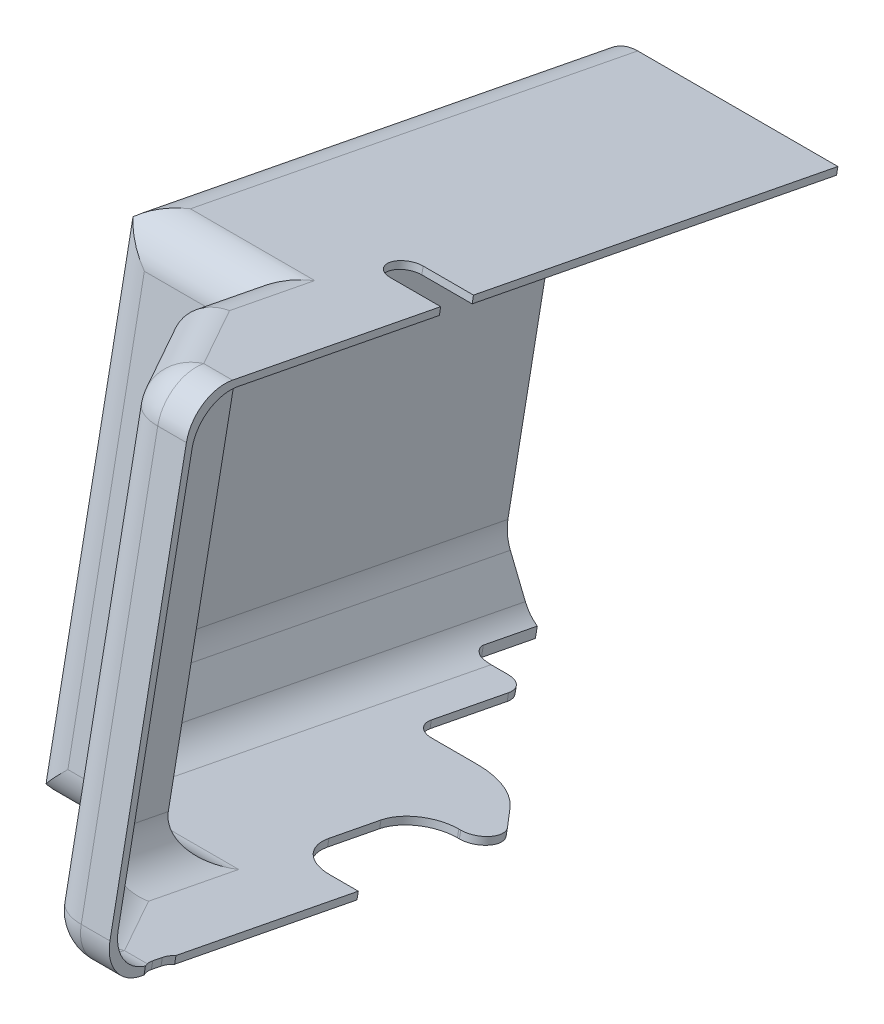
ISO-10303-21;
HEADER;
FILE_DESCRIPTION(('STEP AP214'),'2;1');
FILE_NAME('part.step','',(''),(''),'','','');
FILE_SCHEMA(('AUTOMOTIVE_DESIGN { 1 0 10303 214 1 1 1 1 }'));
ENDSEC;
DATA;
#1=APPLICATION_CONTEXT('core data for automotive mechanical design processes');
#2=APPLICATION_PROTOCOL_DEFINITION('international standard','automotive_design',2000,#1);
#3=PRODUCT_CONTEXT('',#1,'mechanical');
#4=PRODUCT('Part','Part','',(#3));
#5=PRODUCT_RELATED_PRODUCT_CATEGORY('part','',(#4));
#6=PRODUCT_DEFINITION_FORMATION('','',#4);
#7=PRODUCT_DEFINITION_CONTEXT('part definition',#1,'design');
#8=PRODUCT_DEFINITION('design','',#6,#7);
#9=PRODUCT_DEFINITION_SHAPE('','',#8);
#10=(LENGTH_UNIT() NAMED_UNIT(*) SI_UNIT(.MILLI.,.METRE.));
#11=(NAMED_UNIT(*) PLANE_ANGLE_UNIT() SI_UNIT($,.RADIAN.));
#12=(NAMED_UNIT(*) SI_UNIT($,.STERADIAN.) SOLID_ANGLE_UNIT());
#13=UNCERTAINTY_MEASURE_WITH_UNIT(LENGTH_MEASURE(1.E-05),#10,'distance_accuracy_value','');
#14=(GEOMETRIC_REPRESENTATION_CONTEXT(3) GLOBAL_UNCERTAINTY_ASSIGNED_CONTEXT((#13)) GLOBAL_UNIT_ASSIGNED_CONTEXT((#10,
#11,#12)) REPRESENTATION_CONTEXT('',''));
#15=CARTESIAN_POINT('',(0.,0.,0.));
#16=DIRECTION('',(0.,0.,1.));
#17=DIRECTION('',(1.,0.,0.));
#18=AXIS2_PLACEMENT_3D('',#15,#16,#17);
#19=CARTESIAN_POINT('',(-883.336768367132,-311.088732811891,-274.807477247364));
#20=CARTESIAN_POINT('',(-883.279924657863,-311.198776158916,-274.694763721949));
#21=CARTESIAN_POINT('',(-883.220430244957,-311.30936244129,-274.583965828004));
#22=CARTESIAN_POINT('',(-883.158308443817,-311.420448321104,-274.475126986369));
#23=CARTESIAN_POINT('',(-883.492710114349,-311.342727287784,-274.976810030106));
#24=CARTESIAN_POINT('',(-883.435932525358,-311.452642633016,-274.86422761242));
#25=CARTESIAN_POINT('',(-883.376507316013,-311.563100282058,-274.753558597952));
#26=CARTESIAN_POINT('',(-883.314457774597,-311.67405694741,-274.644846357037));
#27=CARTESIAN_POINT('',(-883.637104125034,-311.598434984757,-275.153639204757));
#28=CARTESIAN_POINT('',(-883.580454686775,-311.708102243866,-275.04131089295));
#29=CARTESIAN_POINT('',(-883.521163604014,-311.818310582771,-274.930891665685));
#30=CARTESIAN_POINT('',(-883.45925411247,-311.929016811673,-274.822424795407));
#31=CARTESIAN_POINT('',(-883.769713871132,-311.855437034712,-275.337675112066));
#32=CARTESIAN_POINT('',(-883.713254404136,-311.964736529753,-275.225723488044));
#33=CARTESIAN_POINT('',(-883.654162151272,-312.074575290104,-275.115674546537));
#34=CARTESIAN_POINT('',(-883.592460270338,-312.184910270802,-275.007571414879));
#35=(BOUNDED_SURFACE() B_SPLINE_SURFACE(3,3,((#19,#20,#21,#22),(#23,#24,#25,#26),(#27,#28,#29,
#30),(#31,#32,#33,#34)),.UNSPECIFIED.,.F.,.F.,.F.) B_SPLINE_SURFACE_WITH_KNOTS((4,4),(4,4),(0.,
1.),(0.,1.),.UNSPECIFIED.) GEOMETRIC_REPRESENTATION_ITEM() RATIONAL_B_SPLINE_SURFACE(((1.,
0.999869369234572,0.999869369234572,1.),(0.999453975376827,0.999323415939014,0.999323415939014,
0.999453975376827),(0.999453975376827,0.999323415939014,0.999323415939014,0.999453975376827),
(1.,0.999869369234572,0.999869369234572,1.))) REPRESENTATION_ITEM('') SURFACE());
#36=CARTESIAN_POINT('',(-872.880779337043,-312.847801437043,-281.798040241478));
#37=DIRECTION('',(0.370950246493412,-0.663331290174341,0.649913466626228));
#38=DIRECTION('',(0.,-0.699845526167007,-0.714294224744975));
#39=AXIS2_PLACEMENT_3D('',#36,#37,#38);
#40=CIRCLE('',#39,12.7000000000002);
#41=CARTESIAN_POINT('',(-883.161083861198,-311.424958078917,-274.478145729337));
#42=VERTEX_POINT('',#41);
#43=CARTESIAN_POINT('',(-883.590090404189,-312.180360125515,-275.004279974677));
#44=VERTEX_POINT('',#43);
#45=EDGE_CURVE('E416',#42,#44,#40,.T.);
#46=CARTESIAN_POINT('',(-872.880779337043,-312.847801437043,-281.798040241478));
#47=DIRECTION('',(0.535824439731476,0.161105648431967,0.828816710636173));
#48=DIRECTION('',(0.83978670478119,0.,-0.542916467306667));
#49=AXIS2_PLACEMENT_3D('',#46,#47,#48);
#50=CIRCLE('',#49,12.7);
#51=CARTESIAN_POINT('',(-883.603762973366,-311.549351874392,-275.118096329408));
#52=VERTEX_POINT('',#51);
#53=EDGE_CURVE('E415',#44,#52,#50,.F.);
#54=CARTESIAN_POINT('',(-872.880779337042,-312.847801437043,-281.798040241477));
#55=DIRECTION('',(0.,-0.981627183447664,0.190808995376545));
#56=DIRECTION('',(0.,-0.190808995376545,-0.981627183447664));
#57=AXIS2_PLACEMENT_3D('',#54,#55,#56);
#58=CIRCLE('',#57,12.7);
#59=EDGE_CURVE('E21',#52,#42,#58,.F.);
#60=ORIENTED_EDGE('',*,*,#45,.T.);
#61=ORIENTED_EDGE('',*,*,#53,.T.);
#62=ORIENTED_EDGE('',*,*,#59,.T.);
#63=EDGE_LOOP('',(#60,#61,#62));
#64=FACE_BOUND('',#63,.T.);
#65=ADVANCED_FACE('F17',(#64),#35,.F.);
#66=CARTESIAN_POINT('',(-884.593511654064,-312.896543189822,-272.127288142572));
#67=CARTESIAN_POINT('',(-884.536667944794,-313.006586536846,-272.014574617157));
#68=CARTESIAN_POINT('',(-884.477173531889,-313.117172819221,-271.903776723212));
#69=CARTESIAN_POINT('',(-884.415051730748,-313.228258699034,-271.794937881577));
#70=CARTESIAN_POINT('',(-884.749453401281,-313.150537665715,-272.296620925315));
#71=CARTESIAN_POINT('',(-884.692675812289,-313.260453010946,-272.184038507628));
#72=CARTESIAN_POINT('',(-884.633250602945,-313.370910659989,-272.073369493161));
#73=CARTESIAN_POINT('',(-884.571201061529,-313.481867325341,-271.964657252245));
#74=CARTESIAN_POINT('',(-884.893847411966,-313.406245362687,-272.473450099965));
#75=CARTESIAN_POINT('',(-884.837197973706,-313.515912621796,-272.361121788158));
#76=CARTESIAN_POINT('',(-884.777906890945,-313.626120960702,-272.250702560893));
#77=CARTESIAN_POINT('',(-884.715997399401,-313.736827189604,-272.142235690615));
#78=CARTESIAN_POINT('',(-885.026457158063,-313.663247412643,-272.657486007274));
#79=CARTESIAN_POINT('',(-884.969997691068,-313.772546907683,-272.545534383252));
#80=CARTESIAN_POINT('',(-884.910905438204,-313.882385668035,-272.435485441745));
#81=CARTESIAN_POINT('',(-884.849203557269,-313.992720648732,-272.327382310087));
#82=(BOUNDED_SURFACE() B_SPLINE_SURFACE(3,3,((#66,#67,#68,#69),(#70,#71,#72,#73),(#74,#75,#76,
#77),(#78,#79,#80,#81)),.UNSPECIFIED.,.F.,.F.,.F.) B_SPLINE_SURFACE_WITH_KNOTS((4,4),(4,4),(0.,
1.),(0.,1.),.UNSPECIFIED.) GEOMETRIC_REPRESENTATION_ITEM() RATIONAL_B_SPLINE_SURFACE(((1.,
0.999869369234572,0.999869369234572,1.),(0.999453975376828,0.999323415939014,0.999323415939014,
0.999453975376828),(0.999453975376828,0.999323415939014,0.999323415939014,0.999453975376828),
(1.,0.999869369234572,0.999869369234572,1.))) REPRESENTATION_ITEM('') SURFACE());
#83=CARTESIAN_POINT('',(-874.137522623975,-314.655611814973,-279.117851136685));
#84=DIRECTION('',(0.,-0.981627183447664,0.190808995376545));
#85=DIRECTION('',(0.,-0.190808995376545,-0.981627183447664));
#86=AXIS2_PLACEMENT_3D('',#83,#84,#85);
#87=CIRCLE('',#86,12.7);
#88=CARTESIAN_POINT('',(-884.860506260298,-313.357162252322,-272.437907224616));
#89=VERTEX_POINT('',#88);
#90=CARTESIAN_POINT('',(-884.41782714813,-313.232768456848,-271.797956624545));
#91=VERTEX_POINT('',#90);
#92=EDGE_CURVE('E449',#89,#91,#87,.F.);
#93=CARTESIAN_POINT('',(-874.137522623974,-314.655611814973,-279.117851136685));
#94=DIRECTION('',(0.535824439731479,0.161105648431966,0.828816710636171));
#95=DIRECTION('',(0.839786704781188,0.,-0.54291646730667));
#96=AXIS2_PLACEMENT_3D('',#93,#94,#95);
#97=CIRCLE('',#96,12.7);
#98=CARTESIAN_POINT('',(-884.846833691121,-313.988170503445,-272.324090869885));
#99=VERTEX_POINT('',#98);
#100=EDGE_CURVE('E1097',#99,#89,#97,.F.);
#101=CARTESIAN_POINT('',(-874.137522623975,-314.655611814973,-279.117851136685));
#102=DIRECTION('',(0.370950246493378,-0.663331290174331,0.649913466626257));
#103=DIRECTION('',(0.,-0.699845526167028,-0.714294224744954));
#104=AXIS2_PLACEMENT_3D('',#101,#102,#103);
#105=CIRCLE('',#104,12.6999999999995);
#106=EDGE_CURVE('E447',#91,#99,#105,.T.);
#107=ORIENTED_EDGE('',*,*,#92,.F.);
#108=ORIENTED_EDGE('',*,*,#100,.F.);
#109=ORIENTED_EDGE('',*,*,#106,.F.);
#110=EDGE_LOOP('',(#107,#108,#109));
#111=FACE_BOUND('',#110,.T.);
#112=ADVANCED_FACE('F1650',(#111),#82,.T.);
#113=CARTESIAN_POINT('',(-873.513002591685,-323.877251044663,-393.117779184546));
#114=DIRECTION('',(0.,-0.190808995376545,-0.981627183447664));
#115=DIRECTION('',(0.,0.981627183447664,-0.190808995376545));
#116=AXIS2_PLACEMENT_3D('',#113,#114,#115);
#117=PLANE('',#116);
#118=DIRECTION('',(1.,0.,0.));
#119=VECTOR('',#118,1.);
#120=CARTESIAN_POINT('',(-873.513002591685,-348.810581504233,-388.271230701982));
#121=LINE('',#120,#119);
#122=CARTESIAN_POINT('',(-873.513002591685,-348.810581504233,-388.271230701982));
#123=VERTEX_POINT('',#122);
#124=CARTESIAN_POINT('',(-874.134429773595,-348.810581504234,-388.271230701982));
#125=VERTEX_POINT('',#124);
#126=EDGE_CURVE('E413',#123,#125,#121,.F.);
#127=ORIENTED_EDGE('',*,*,#126,.F.);
#128=DIRECTION('',(0.,-0.981627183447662,0.190808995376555));
#129=VECTOR('',#128,1.);
#130=CARTESIAN_POINT('',(-873.513002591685,-346.566581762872,-388.707420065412));
#131=LINE('',#130,#129);
#132=CARTESIAN_POINT('',(-873.513002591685,-346.566581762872,-388.707420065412));
#133=VERTEX_POINT('',#132);
#134=EDGE_CURVE('E1081',#133,#123,#131,.T.);
#135=ORIENTED_EDGE('',*,*,#134,.F.);
#136=DIRECTION('',(1.,0.,0.));
#137=VECTOR('',#136,1.);
#138=CARTESIAN_POINT('',(-873.513002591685,-346.566581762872,-388.707420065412));
#139=LINE('',#138,#137);
#140=CARTESIAN_POINT('',(-874.134429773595,-346.566581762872,-388.707420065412));
#141=VERTEX_POINT('',#140);
#142=EDGE_CURVE('E464',#141,#133,#139,.T.);
#143=ORIENTED_EDGE('',*,*,#142,.F.);
#144=DIRECTION('',(0.,-0.981627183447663,0.190808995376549));
#145=VECTOR('',#144,1.);
#146=CARTESIAN_POINT('',(-874.134429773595,-346.566581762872,-388.707420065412));
#147=LINE('',#146,#145);
#148=EDGE_CURVE('E1077',#141,#125,#147,.T.);
#149=ORIENTED_EDGE('',*,*,#148,.T.);
#150=EDGE_LOOP('',(#127,#135,#143,#149));
#151=FACE_BOUND('',#150,.T.);
#152=ADVANCED_FACE('F1580',(#151),#117,.F.);
#153=CARTESIAN_POINT('',(-872.880779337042,-190.175815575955,-305.643058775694));
#154=DIRECTION('',(0.,-0.981627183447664,0.190808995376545));
#155=DIRECTION('',(0.,-0.190808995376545,-0.981627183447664));
#156=AXIS2_PLACEMENT_3D('',#153,#154,#155);
#157=CYLINDRICAL_SURFACE('',#156,12.7);
#158=CARTESIAN_POINT('',(-872.880779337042,-190.175815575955,-305.643058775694));
#159=DIRECTION('',(0.,-0.981627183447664,0.190808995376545));
#160=DIRECTION('',(0.,-0.190808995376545,-0.981627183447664));
#161=AXIS2_PLACEMENT_3D('',#158,#159,#160);
#162=CIRCLE('',#161,12.7);
#163=CARTESIAN_POINT('',(-883.603762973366,-188.877366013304,-298.963114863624));
#164=VERTEX_POINT('',#163);
#165=CARTESIAN_POINT('',(-872.880779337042,-187.752541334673,-293.176393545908));
#166=VERTEX_POINT('',#165);
#167=EDGE_CURVE('E430',#164,#166,#162,.F.);
#168=ORIENTED_EDGE('',*,*,#167,.T.);
#169=DIRECTION('',(0.,-0.981627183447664,0.190808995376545));
#170=VECTOR('',#169,1.);
#171=CARTESIAN_POINT('',(-872.880779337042,-175.285876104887,-295.59966778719));
#172=LINE('',#171,#170);
#173=CARTESIAN_POINT('',(-872.880779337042,-310.424527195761,-269.331375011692));
#174=VERTEX_POINT('',#173);
#175=EDGE_CURVE('E450',#166,#174,#172,.T.);
#176=ORIENTED_EDGE('',*,*,#175,.T.);
#177=CARTESIAN_POINT('',(-872.880779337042,-312.847801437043,-281.798040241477));
#178=DIRECTION('',(0.,-0.981627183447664,0.190808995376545));
#179=DIRECTION('',(0.,-0.190808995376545,-0.981627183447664));
#180=AXIS2_PLACEMENT_3D('',#177,#178,#179);
#181=CIRCLE('',#180,12.7);
#182=EDGE_CURVE('E410',#174,#42,#181,.T.);
#183=ORIENTED_EDGE('',*,*,#182,.T.);
#184=ORIENTED_EDGE('',*,*,#59,.F.);
#185=DIRECTION('',(0.,0.981627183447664,-0.190808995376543));
#186=VECTOR('',#185,1.);
#187=CARTESIAN_POINT('',(-883.603762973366,-311.549351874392,-275.118096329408));
#188=LINE('',#187,#186);
#189=EDGE_CURVE('E407',#52,#164,#188,.T.);
#190=ORIENTED_EDGE('',*,*,#189,.T.);
#191=EDGE_LOOP('',(#168,#176,#183,#184,#190));
#192=FACE_BOUND('',#191,.T.);
#193=ADVANCED_FACE('F405',(#192),#157,.F.);
#194=CARTESIAN_POINT('',(-872.880779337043,-312.847801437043,-281.798040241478));
#195=DIRECTION('',(0.489945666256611,0.734312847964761,0.469827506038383));
#196=DIRECTION('',(-0.78889109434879,0.144139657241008,0.597389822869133));
#197=AXIS2_PLACEMENT_3D('',#194,#195,#196);
#198=SPHERICAL_SURFACE('',#197,12.7000000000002);
#199=ORIENTED_EDGE('',*,*,#182,.F.);
#200=CARTESIAN_POINT('',(-872.880779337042,-312.847801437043,-281.798040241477));
#201=DIRECTION('',(1.,0.,0.));
#202=DIRECTION('',(0.,0.,-1.));
#203=AXIS2_PLACEMENT_3D('',#200,#201,#202);
#204=CIRCLE('',#203,12.7);
#205=CARTESIAN_POINT('',(-872.880779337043,-325.314466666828,-279.374766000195));
#206=VERTEX_POINT('',#205);
#207=EDGE_CURVE('E738',#174,#206,#204,.T.);
#208=ORIENTED_EDGE('',*,*,#207,.T.);
#209=CARTESIAN_POINT('',(-872.880779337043,-312.847801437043,-281.798040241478));
#210=DIRECTION('',(0.535824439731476,0.161105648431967,0.828816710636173));
#211=DIRECTION('',(0.83978670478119,0.,-0.542916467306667));
#212=AXIS2_PLACEMENT_3D('',#209,#210,#211);
#213=CIRCLE('',#212,12.7);
#214=EDGE_CURVE('E438',#206,#44,#213,.F.);
#215=ORIENTED_EDGE('',*,*,#214,.T.);
#216=ORIENTED_EDGE('',*,*,#45,.F.);
#217=EDGE_LOOP('',(#199,#208,#215,#216));
#218=FACE_BOUND('',#217,.T.);
#219=ADVANCED_FACE('F1132',(#218),#198,.F.);
#220=CARTESIAN_POINT('',(-874.137522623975,-314.655611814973,-279.117851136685));
#221=DIRECTION('',(0.489945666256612,0.734312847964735,0.469827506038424));
#222=DIRECTION('',(-0.788891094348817,0.144139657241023,0.597389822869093));
#223=AXIS2_PLACEMENT_3D('',#220,#221,#222);
#224=SPHERICAL_SURFACE('',#223,12.6999999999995);
#225=CARTESIAN_POINT('',(-874.137522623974,-314.655611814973,-279.117851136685));
#226=DIRECTION('',(0.535824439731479,0.161105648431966,0.828816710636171));
#227=DIRECTION('',(0.839786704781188,0.,-0.54291646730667));
#228=AXIS2_PLACEMENT_3D('',#225,#226,#227);
#229=CIRCLE('',#228,12.7);
#230=CARTESIAN_POINT('',(-874.137522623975,-327.122277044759,-276.694576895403));
#231=VERTEX_POINT('',#230);
#232=EDGE_CURVE('E1140',#231,#99,#229,.F.);
#233=ORIENTED_EDGE('',*,*,#232,.F.);
#234=CARTESIAN_POINT('',(-874.137522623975,-314.655611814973,-279.117851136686));
#235=DIRECTION('',(1.,0.,0.));
#236=DIRECTION('',(0.,0.,-1.));
#237=AXIS2_PLACEMENT_3D('',#234,#235,#236);
#238=CIRCLE('',#237,12.7);
#239=CARTESIAN_POINT('',(-874.137522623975,-312.232337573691,-266.6511859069));
#240=VERTEX_POINT('',#239);
#241=EDGE_CURVE('E727',#240,#231,#238,.T.);
#242=ORIENTED_EDGE('',*,*,#241,.F.);
#243=CARTESIAN_POINT('',(-874.137522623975,-314.655611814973,-279.117851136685));
#244=DIRECTION('',(0.,-0.981627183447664,0.190808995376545));
#245=DIRECTION('',(0.,-0.190808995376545,-0.981627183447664));
#246=AXIS2_PLACEMENT_3D('',#243,#244,#245);
#247=CIRCLE('',#246,12.7);
#248=EDGE_CURVE('E431',#91,#240,#247,.F.);
#249=ORIENTED_EDGE('',*,*,#248,.F.);
#250=ORIENTED_EDGE('',*,*,#106,.T.);
#251=EDGE_LOOP('',(#233,#242,#249,#250));
#252=FACE_BOUND('',#251,.T.);
#253=ADVANCED_FACE('F1171',(#252),#224,.T.);
#254=CARTESIAN_POINT('',(-874.137522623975,-187.495626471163,-303.835248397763));
#255=DIRECTION('',(0.,-0.981627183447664,0.190808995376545));
#256=DIRECTION('',(0.,-0.190808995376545,-0.981627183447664));
#257=AXIS2_PLACEMENT_3D('',#254,#255,#256);
#258=CYLINDRICAL_SURFACE('',#257,12.7);
#259=CARTESIAN_POINT('',(-874.137522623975,-187.495626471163,-303.835248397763));
#260=DIRECTION('',(0.,-0.981627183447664,0.190808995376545));
#261=DIRECTION('',(0.,-0.190808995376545,-0.981627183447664));
#262=AXIS2_PLACEMENT_3D('',#259,#260,#261);
#263=CIRCLE('',#262,12.7);
#264=CARTESIAN_POINT('',(-884.860506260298,-186.197176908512,-297.155304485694));
#265=VERTEX_POINT('',#264);
#266=CARTESIAN_POINT('',(-874.137522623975,-185.072352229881,-291.368583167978));
#267=VERTEX_POINT('',#266);
#268=EDGE_CURVE('E723',#265,#267,#263,.F.);
#269=ORIENTED_EDGE('',*,*,#268,.F.);
#270=DIRECTION('',(0.,0.981627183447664,-0.190808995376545));
#271=VECTOR('',#270,1.);
#272=CARTESIAN_POINT('',(-884.860506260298,-313.357162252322,-272.437907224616));
#273=LINE('',#272,#271);
#274=EDGE_CURVE('E459',#89,#265,#273,.T.);
#275=ORIENTED_EDGE('',*,*,#274,.F.);
#276=ORIENTED_EDGE('',*,*,#92,.T.);
#277=ORIENTED_EDGE('',*,*,#248,.T.);
#278=DIRECTION('',(0.,-0.981627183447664,0.190808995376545));
#279=VECTOR('',#278,1.);
#280=CARTESIAN_POINT('',(-874.137522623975,-172.605687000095,-293.79185740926));
#281=LINE('',#280,#279);
#282=EDGE_CURVE('E726',#267,#240,#281,.T.);
#283=ORIENTED_EDGE('',*,*,#282,.F.);
#284=EDGE_LOOP('',(#269,#275,#276,#277,#283));
#285=FACE_BOUND('',#284,.T.);
#286=ADVANCED_FACE('F1178',(#285),#258,.T.);
#287=CARTESIAN_POINT('',(-899.788429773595,-181.276923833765,-326.420936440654));
#288=DIRECTION('',(-0.844329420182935,0.102240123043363,0.52597983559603));
#289=DIRECTION('',(0.528750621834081,0.,0.848777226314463));
#290=AXIS2_PLACEMENT_3D('',#287,#288,#289);
#291=PLANE('',#290);
#292=DIRECTION('',(0.535824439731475,0.161105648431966,0.828816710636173));
#293=VECTOR('',#292,1.);
#294=CARTESIAN_POINT('',(-899.303008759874,-193.597638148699,-323.246809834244));
#295=LINE('',#294,#293);
#296=CARTESIAN_POINT('',(-899.788429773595,-193.74358906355,-323.997662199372));
#297=VERTEX_POINT('',#296);
#298=EDGE_CURVE('E428',#297,#164,#295,.T.);
#299=ORIENTED_EDGE('',*,*,#298,.T.);
#300=ORIENTED_EDGE('',*,*,#189,.F.);
#301=DIRECTION('',(0.535824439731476,0.161105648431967,0.828816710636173));
#302=VECTOR('',#301,1.);
#303=CARTESIAN_POINT('',(-899.303008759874,-316.269624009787,-299.401791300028));
#304=LINE('',#303,#302);
#305=CARTESIAN_POINT('',(-899.788429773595,-316.415574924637,-300.152643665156));
#306=VERTEX_POINT('',#305);
#307=EDGE_CURVE('E421',#52,#306,#304,.F.);
#308=ORIENTED_EDGE('',*,*,#307,.T.);
#309=DIRECTION('',(0.,0.981627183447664,-0.190808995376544));
#310=VECTOR('',#309,1.);
#311=CARTESIAN_POINT('',(-899.788429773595,-316.415574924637,-300.152643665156));
#312=LINE('',#311,#310);
#313=EDGE_CURVE('E422',#306,#297,#312,.T.);
#314=ORIENTED_EDGE('',*,*,#313,.T.);
#315=EDGE_LOOP('',(#299,#300,#308,#314));
#316=FACE_BOUND('',#315,.T.);
#317=ADVANCED_FACE('F425',(#316),#291,.F.);
#318=CARTESIAN_POINT('',(-872.880779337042,-190.175815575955,-305.643058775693));
#319=DIRECTION('',(0.48994566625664,0.734312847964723,0.469827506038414));
#320=DIRECTION('',(-0.391532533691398,0.666886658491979,-0.634006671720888));
#321=AXIS2_PLACEMENT_3D('',#318,#319,#320);
#322=SPHERICAL_SURFACE('',#321,12.7000000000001);
#323=CARTESIAN_POINT('',(-872.880779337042,-190.175815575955,-305.643058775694));
#324=DIRECTION('',(1.,0.,0.));
#325=DIRECTION('',(0.,1.,0.));
#326=AXIS2_PLACEMENT_3D('',#323,#324,#325);
#327=CIRCLE('',#326,12.7);
#328=CARTESIAN_POINT('',(-872.880779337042,-177.70915034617,-308.066333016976));
#329=VERTEX_POINT('',#328);
#330=EDGE_CURVE('E719',#329,#166,#327,.T.);
#331=ORIENTED_EDGE('',*,*,#330,.T.);
#332=ORIENTED_EDGE('',*,*,#167,.F.);
#333=CARTESIAN_POINT('',(-872.880779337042,-190.175815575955,-305.643058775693));
#334=DIRECTION('',(0.535824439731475,0.161105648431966,0.828816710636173));
#335=DIRECTION('',(0.83978670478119,0.,-0.542916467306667));
#336=AXIS2_PLACEMENT_3D('',#333,#334,#335);
#337=CIRCLE('',#336,12.7);
#338=EDGE_CURVE('E717',#164,#329,#337,.F.);
#339=ORIENTED_EDGE('',*,*,#338,.T.);
#340=EDGE_LOOP('',(#331,#332,#339));
#341=FACE_BOUND('',#340,.T.);
#342=ADVANCED_FACE('F1123',(#341),#322,.F.);
#343=CARTESIAN_POINT('',(-899.788429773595,-185.221300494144,-346.71299522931));
#344=DIRECTION('',(-1.,0.,0.));
#345=DIRECTION('',(0.,-1.,0.));
#346=AXIS2_PLACEMENT_3D('',#343,#344,#345);
#347=PLANE('',#346);
#348=DIRECTION('',(0.,0.190808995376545,0.981627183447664));
#349=VECTOR('',#348,1.);
#350=CARTESIAN_POINT('',(-899.788429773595,-200.148208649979,-356.946573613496));
#351=LINE('',#350,#349);
#352=CARTESIAN_POINT('',(-899.788429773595,-197.68796572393,-344.289720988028));
#353=VERTEX_POINT('',#352);
#354=EDGE_CURVE('E716',#353,#297,#351,.T.);
#355=ORIENTED_EDGE('',*,*,#354,.T.);
#356=ORIENTED_EDGE('',*,*,#313,.F.);
#357=DIRECTION('',(0.,0.190808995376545,0.981627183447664));
#358=VECTOR('',#357,1.);
#359=CARTESIAN_POINT('',(-899.788429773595,-322.820194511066,-333.10155507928));
#360=LINE('',#359,#358);
#361=CARTESIAN_POINT('',(-899.788429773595,-320.359951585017,-320.444702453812));
#362=VERTEX_POINT('',#361);
#363=EDGE_CURVE('E1101',#306,#362,#360,.F.);
#364=ORIENTED_EDGE('',*,*,#363,.T.);
#365=DIRECTION('',(0.,-0.981627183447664,0.190808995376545));
#366=VECTOR('',#365,1.);
#367=CARTESIAN_POINT('',(-899.788429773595,-185.221300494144,-346.71299522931));
#368=LINE('',#367,#366);
#369=EDGE_CURVE('E440',#362,#353,#368,.F.);
#370=ORIENTED_EDGE('',*,*,#369,.T.);
#371=EDGE_LOOP('',(#355,#356,#364,#370));
#372=FACE_BOUND('',#371,.T.);
#373=ADVANCED_FACE('F1105',(#372),#347,.F.);
#374=CARTESIAN_POINT('',(-888.580025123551,-317.568073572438,-306.081735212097));
#375=DIRECTION('',(0.535824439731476,0.161105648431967,0.828816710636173));
#376=DIRECTION('',(0.83978670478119,0.,-0.542916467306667));
#377=AXIS2_PLACEMENT_3D('',#374,#375,#376);
#378=CYLINDRICAL_SURFACE('',#377,12.7);
#379=DIRECTION('',(-0.535824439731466,-0.161105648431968,-0.828816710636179));
#380=VECTOR('',#379,1.);
#381=CARTESIAN_POINT('',(-872.880779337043,-325.314466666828,-279.374766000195));
#382=LINE('',#381,#380);
#383=CARTESIAN_POINT('',(-887.088429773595,-329.586262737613,-301.351251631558));
#384=VERTEX_POINT('',#383);
#385=EDGE_CURVE('E444',#206,#384,#382,.T.);
#386=ORIENTED_EDGE('',*,*,#385,.T.);
#387=CARTESIAN_POINT('',(-887.088429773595,-317.119597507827,-303.77452587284));
#388=DIRECTION('',(0.278989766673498,0.183232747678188,0.942650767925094));
#389=DIRECTION('',(-0.960294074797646,0.0532337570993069,0.273863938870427));
#390=AXIS2_PLACEMENT_3D('',#387,#388,#389);
#391=ELLIPSE('',#390,13.2251154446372,12.7);
#392=EDGE_CURVE('E436',#384,#306,#391,.F.);
#393=ORIENTED_EDGE('',*,*,#392,.T.);
#394=ORIENTED_EDGE('',*,*,#307,.F.);
#395=ORIENTED_EDGE('',*,*,#53,.F.);
#396=ORIENTED_EDGE('',*,*,#214,.F.);
#397=EDGE_LOOP('',(#386,#393,#394,#395,#396));
#398=FACE_BOUND('',#397,.T.);
#399=ADVANCED_FACE('F434',(#398),#378,.F.);
#400=CARTESIAN_POINT('',(-935.140999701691,-185.221300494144,-346.71299522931));
#401=DIRECTION('',(0.,0.190808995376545,0.981627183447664));
#402=DIRECTION('',(0.,-0.981627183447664,0.190808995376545));
#403=AXIS2_PLACEMENT_3D('',#400,#401,#402);
#404=PLANE('',#403);
#405=DIRECTION('',(1.,0.,0.));
#406=VECTOR('',#405,1.);
#407=CARTESIAN_POINT('',(-936.556892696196,-320.359951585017,-320.444702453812));
#408=LINE('',#407,#406);
#409=CARTESIAN_POINT('',(-935.140999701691,-320.359951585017,-320.444702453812));
#410=VERTEX_POINT('',#409);
#411=EDGE_CURVE('E674',#362,#410,#408,.F.);
#412=ORIENTED_EDGE('',*,*,#411,.T.);
#413=DIRECTION('',(0.,0.981627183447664,-0.190808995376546));
#414=VECTOR('',#413,1.);
#415=CARTESIAN_POINT('',(-935.140999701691,-320.359951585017,-320.444702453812));
#416=LINE('',#415,#414);
#417=CARTESIAN_POINT('',(-935.140999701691,-197.68796572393,-344.289720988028));
#418=VERTEX_POINT('',#417);
#419=EDGE_CURVE('E706',#410,#418,#416,.T.);
#420=ORIENTED_EDGE('',*,*,#419,.T.);
#421=DIRECTION('',(-1.,0.,0.));
#422=VECTOR('',#421,1.);
#423=CARTESIAN_POINT('',(-886.793389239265,-197.68796572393,-344.289720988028));
#424=LINE('',#423,#422);
#425=EDGE_CURVE('E713',#418,#353,#424,.F.);
#426=ORIENTED_EDGE('',*,*,#425,.T.);
#427=ORIENTED_EDGE('',*,*,#369,.F.);
#428=EDGE_LOOP('',(#412,#420,#426,#427));
#429=FACE_BOUND('',#428,.T.);
#430=ADVANCED_FACE('F1108',(#429),#404,.F.);
#431=CARTESIAN_POINT('',(-887.088429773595,-322.820194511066,-333.10155507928));
#432=DIRECTION('',(0.,0.190808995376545,0.981627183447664));
#433=DIRECTION('',(0.,-0.981627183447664,0.190808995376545));
#434=AXIS2_PLACEMENT_3D('',#431,#432,#433);
#435=CYLINDRICAL_SURFACE('',#434,12.7);
#436=DIRECTION('',(0.,-0.190808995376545,-0.981627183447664));
#437=VECTOR('',#436,1.);
#438=CARTESIAN_POINT('',(-887.088429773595,-328.882240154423,-297.729369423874));
#439=LINE('',#438,#437);
#440=CARTESIAN_POINT('',(-887.088429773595,-335.249891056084,-330.488093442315));
#441=VERTEX_POINT('',#440);
#442=EDGE_CURVE('E1009',#384,#441,#439,.T.);
#443=ORIENTED_EDGE('',*,*,#442,.T.);
#444=CARTESIAN_POINT('',(-887.088429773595,-322.783225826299,-332.911367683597));
#445=DIRECTION('',(0.707106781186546,0.134922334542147,0.694115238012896));
#446=DIRECTION('',(-0.707106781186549,0.134922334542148,0.694115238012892));
#447=AXIS2_PLACEMENT_3D('',#444,#445,#446);
#448=ELLIPSE('',#447,17.9605122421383,12.7);
#449=EDGE_CURVE('E666',#441,#362,#448,.F.);
#450=ORIENTED_EDGE('',*,*,#449,.T.);
#451=ORIENTED_EDGE('',*,*,#363,.F.);
#452=ORIENTED_EDGE('',*,*,#392,.F.);
#453=EDGE_LOOP('',(#443,#450,#451,#452));
#454=FACE_BOUND('',#453,.T.);
#455=ADVANCED_FACE('F1627',(#454),#435,.F.);
#456=CARTESIAN_POINT('',(-890.872200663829,-319.687206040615,-305.003159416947));
#457=DIRECTION('',(0.535824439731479,0.161105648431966,0.828816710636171));
#458=DIRECTION('',(0.839786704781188,0.,-0.54291646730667));
#459=AXIS2_PLACEMENT_3D('',#456,#457,#458);
#460=CYLINDRICAL_SURFACE('',#459,12.7);
#461=DIRECTION('',(0.535824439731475,0.161105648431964,0.828816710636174));
#462=VECTOR('',#461,1.);
#463=CARTESIAN_POINT('',(-902.074429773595,-318.532850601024,-299.064515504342));
#464=LINE('',#463,#462);
#465=CARTESIAN_POINT('',(-902.074429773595,-318.532850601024,-299.064515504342));
#466=VERTEX_POINT('',#465);
#467=EDGE_CURVE('E460',#466,#89,#464,.T.);
#468=ORIENTED_EDGE('',*,*,#467,.F.);
#469=CARTESIAN_POINT('',(-889.374429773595,-319.236873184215,-302.686397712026));
#470=DIRECTION('',(0.2789897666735,0.183232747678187,0.942650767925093));
#471=DIRECTION('',(-0.960294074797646,0.0532337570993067,0.273863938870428));
#472=AXIS2_PLACEMENT_3D('',#469,#470,#471);
#473=ELLIPSE('',#472,13.2251154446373,12.7);
#474=CARTESIAN_POINT('',(-889.374429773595,-331.703538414,-300.263123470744));
#475=VERTEX_POINT('',#474);
#476=EDGE_CURVE('E463',#475,#466,#473,.F.);
#477=ORIENTED_EDGE('',*,*,#476,.F.);
#478=DIRECTION('',(-0.535824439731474,-0.161105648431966,-0.828816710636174));
#479=VECTOR('',#478,1.);
#480=CARTESIAN_POINT('',(-874.137522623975,-327.122277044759,-276.694576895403));
#481=LINE('',#480,#479);
#482=EDGE_CURVE('E1048',#231,#475,#481,.T.);
#483=ORIENTED_EDGE('',*,*,#482,.F.);
#484=ORIENTED_EDGE('',*,*,#232,.T.);
#485=ORIENTED_EDGE('',*,*,#100,.T.);
#486=EDGE_LOOP('',(#468,#477,#483,#484,#485));
#487=FACE_BOUND('',#486,.T.);
#488=ADVANCED_FACE('F1167',(#487),#460,.T.);
#489=CARTESIAN_POINT('',(-921.759429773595,-357.71364327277,-446.054080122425));
#490=DIRECTION('',(0.,-0.981627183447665,0.190808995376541));
#491=DIRECTION('',(0.,-0.190808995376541,-0.981627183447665));
#492=AXIS2_PLACEMENT_3D('',#489,#490,#491);
#493=CYLINDRICAL_SURFACE('',#492,6.35);
#494=CARTESIAN_POINT('',(-921.759429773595,-359.957643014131,-445.617890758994));
#495=DIRECTION('',(0.,-0.981627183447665,0.190808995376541));
#496=DIRECTION('',(0.,-0.190808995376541,-0.981627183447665));
#497=AXIS2_PLACEMENT_3D('',#494,#495,#496);
#498=CIRCLE('',#497,6.35);
#499=CARTESIAN_POINT('',(-921.759429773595,-361.169280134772,-451.851223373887));
#500=VERTEX_POINT('',#499);
#501=CARTESIAN_POINT('',(-915.409429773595,-359.957643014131,-445.617890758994));
#502=VERTEX_POINT('',#501);
#503=EDGE_CURVE('E662',#500,#502,#498,.T.);
#504=ORIENTED_EDGE('',*,*,#503,.F.);
#505=DIRECTION('',(0.,-0.981627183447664,0.190808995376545));
#506=VECTOR('',#505,1.);
#507=CARTESIAN_POINT('',(-921.759429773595,-336.235949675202,-456.697771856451));
#508=LINE('',#507,#506);
#509=CARTESIAN_POINT('',(-921.759429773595,-358.925280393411,-452.287412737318));
#510=VERTEX_POINT('',#509);
#511=EDGE_CURVE('E705',#500,#510,#508,.F.);
#512=ORIENTED_EDGE('',*,*,#511,.T.);
#513=CARTESIAN_POINT('',(-921.759429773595,-357.71364327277,-446.054080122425));
#514=DIRECTION('',(0.,-0.981627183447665,0.190808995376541));
#515=DIRECTION('',(0.,-0.190808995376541,-0.981627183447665));
#516=AXIS2_PLACEMENT_3D('',#513,#514,#515);
#517=CIRCLE('',#516,6.35);
#518=CARTESIAN_POINT('',(-915.409429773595,-357.71364327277,-446.054080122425));
#519=VERTEX_POINT('',#518);
#520=EDGE_CURVE('E695',#510,#519,#517,.T.);
#521=ORIENTED_EDGE('',*,*,#520,.T.);
#522=DIRECTION('',(0.,-0.981627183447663,0.190808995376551));
#523=VECTOR('',#522,1.);
#524=CARTESIAN_POINT('',(-915.409429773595,-357.71364327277,-446.054080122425));
#525=LINE('',#524,#523);
#526=EDGE_CURVE('E1095',#519,#502,#525,.T.);
#527=ORIENTED_EDGE('',*,*,#526,.T.);
#528=EDGE_LOOP('',(#504,#512,#521,#527));
#529=FACE_BOUND('',#528,.T.);
#530=ADVANCED_FACE('F1549',(#529),#493,.T.);
#531=CARTESIAN_POINT('',(-915.409429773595,-335.02431255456,-450.464439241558));
#532=DIRECTION('',(-1.,0.,0.));
#533=DIRECTION('',(0.,0.,1.));
#534=AXIS2_PLACEMENT_3D('',#531,#532,#533);
#535=PLANE('',#534);
#536=DIRECTION('',(0.,-0.190808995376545,-0.981627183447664));
#537=VECTOR('',#536,1.);
#538=CARTESIAN_POINT('',(-915.409429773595,-330.99951583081,-296.64124126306));
#539=LINE('',#538,#537);
#540=CARTESIAN_POINT('',(-915.409429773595,-355.111094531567,-420.684560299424));
#541=VERTEX_POINT('',#540);
#542=EDGE_CURVE('E661',#502,#541,#539,.F.);
#543=ORIENTED_EDGE('',*,*,#542,.F.);
#544=ORIENTED_EDGE('',*,*,#526,.F.);
#545=DIRECTION('',(0.,-0.190808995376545,-0.981627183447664));
#546=VECTOR('',#545,1.);
#547=CARTESIAN_POINT('',(-915.409429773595,-328.882240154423,-297.729369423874));
#548=LINE('',#547,#546);
#549=CARTESIAN_POINT('',(-915.409429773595,-352.867094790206,-421.120749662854));
#550=VERTEX_POINT('',#549);
#551=EDGE_CURVE('E694',#519,#550,#548,.F.);
#552=ORIENTED_EDGE('',*,*,#551,.T.);
#553=DIRECTION('',(0.,-0.981627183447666,0.190808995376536));
#554=VECTOR('',#553,1.);
#555=CARTESIAN_POINT('',(-915.409429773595,-352.867094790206,-421.120749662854));
#556=LINE('',#555,#554);
#557=EDGE_CURVE('E1093',#550,#541,#556,.T.);
#558=ORIENTED_EDGE('',*,*,#557,.T.);
#559=EDGE_LOOP('',(#543,#544,#552,#558));
#560=FACE_BOUND('',#559,.T.);
#561=ADVANCED_FACE('F1554',(#560),#535,.F.);
#562=CARTESIAN_POINT('',(-909.059429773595,-352.867094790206,-421.120749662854));
#563=DIRECTION('',(0.,-0.981627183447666,0.190808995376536));
#564=DIRECTION('',(0.,-0.190808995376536,-0.981627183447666));
#565=AXIS2_PLACEMENT_3D('',#562,#563,#564);
#566=CYLINDRICAL_SURFACE('',#565,6.35000000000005);
#567=DIRECTION('',(0.,-0.981627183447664,0.190808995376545));
#568=VECTOR('',#567,1.);
#569=CARTESIAN_POINT('',(-909.059429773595,-328.966126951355,-419.297776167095));
#570=LINE('',#569,#568);
#571=CARTESIAN_POINT('',(-909.059429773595,-351.655457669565,-414.887417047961));
#572=VERTEX_POINT('',#571);
#573=CARTESIAN_POINT('',(-909.059429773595,-353.899457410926,-414.451227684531));
#574=VERTEX_POINT('',#573);
#575=EDGE_CURVE('E1091',#572,#574,#570,.T.);
#576=ORIENTED_EDGE('',*,*,#575,.T.);
#577=CARTESIAN_POINT('',(-909.059429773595,-355.111094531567,-420.684560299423));
#578=DIRECTION('',(0.,-0.981627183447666,0.190808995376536));
#579=DIRECTION('',(0.,-0.190808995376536,-0.981627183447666));
#580=AXIS2_PLACEMENT_3D('',#577,#578,#579);
#581=CIRCLE('',#580,6.35000000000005);
#582=EDGE_CURVE('E658',#541,#574,#581,.F.);
#583=ORIENTED_EDGE('',*,*,#582,.F.);
#584=ORIENTED_EDGE('',*,*,#557,.F.);
#585=CARTESIAN_POINT('',(-909.059429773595,-352.867094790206,-421.120749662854));
#586=DIRECTION('',(0.,-0.981627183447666,0.190808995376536));
#587=DIRECTION('',(0.,-0.190808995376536,-0.981627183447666));
#588=AXIS2_PLACEMENT_3D('',#585,#586,#587);
#589=CIRCLE('',#588,6.35000000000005);
#590=EDGE_CURVE('E692',#550,#572,#589,.F.);
#591=ORIENTED_EDGE('',*,*,#590,.T.);
#592=EDGE_LOOP('',(#576,#583,#584,#591));
#593=FACE_BOUND('',#592,.T.);
#594=ADVANCED_FACE('F1559',(#593),#566,.F.);
#595=CARTESIAN_POINT('',(-909.059429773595,-328.966126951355,-419.297776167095));
#596=DIRECTION('',(0.,0.190808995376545,0.981627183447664));
#597=DIRECTION('',(0.,-0.981627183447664,0.190808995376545));
#598=AXIS2_PLACEMENT_3D('',#595,#596,#597);
#599=PLANE('',#598);
#600=DIRECTION('',(1.,0.,0.));
#601=VECTOR('',#600,1.);
#602=CARTESIAN_POINT('',(-902.074429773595,-353.899457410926,-414.451227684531));
#603=LINE('',#602,#601);
#604=CARTESIAN_POINT('',(-894.354971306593,-353.899457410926,-414.451227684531));
#605=VERTEX_POINT('',#604);
#606=EDGE_CURVE('E657',#574,#605,#603,.T.);
#607=ORIENTED_EDGE('',*,*,#606,.F.);
#608=ORIENTED_EDGE('',*,*,#575,.F.);
#609=DIRECTION('',(1.,0.,0.));
#610=VECTOR('',#609,1.);
#611=CARTESIAN_POINT('',(-899.788429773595,-351.655457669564,-414.887417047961));
#612=LINE('',#611,#610);
#613=CARTESIAN_POINT('',(-894.354971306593,-351.655457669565,-414.887417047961));
#614=VERTEX_POINT('',#613);
#615=EDGE_CURVE('E691',#572,#614,#612,.T.);
#616=ORIENTED_EDGE('',*,*,#615,.T.);
#617=DIRECTION('',(0.,-0.981627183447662,0.190808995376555));
#618=VECTOR('',#617,1.);
#619=CARTESIAN_POINT('',(-894.354971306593,-351.655457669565,-414.887417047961));
#620=LINE('',#619,#618);
#621=EDGE_CURVE('E1088',#605,#614,#620,.F.);
#622=ORIENTED_EDGE('',*,*,#621,.F.);
#623=EDGE_LOOP('',(#607,#608,#616,#622));
#624=FACE_BOUND('',#623,.T.);
#625=ADVANCED_FACE('F1564',(#624),#599,.F.);
#626=CARTESIAN_POINT('',(-894.354971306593,-346.808909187,-389.954086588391));
#627=DIRECTION('',(0.,-0.981627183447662,0.190808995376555));
#628=DIRECTION('',(0.,-0.190808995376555,-0.981627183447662));
#629=AXIS2_PLACEMENT_3D('',#626,#627,#628);
#630=CYLINDRICAL_SURFACE('',#629,25.4);
#631=CARTESIAN_POINT('',(-894.354971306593,-349.052908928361,-389.51789722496));
#632=DIRECTION('',(0.,-0.981627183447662,0.190808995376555));
#633=DIRECTION('',(0.,-0.190808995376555,-0.981627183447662));
#634=AXIS2_PLACEMENT_3D('',#631,#632,#633);
#635=CIRCLE('',#634,25.4);
#636=CARTESIAN_POINT('',(-875.206360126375,-352.237137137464,-405.899331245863));
#637=VERTEX_POINT('',#636);
#638=EDGE_CURVE('E654',#605,#637,#635,.T.);
#639=ORIENTED_EDGE('',*,*,#638,.F.);
#640=ORIENTED_EDGE('',*,*,#621,.T.);
#641=CARTESIAN_POINT('',(-894.354971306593,-346.808909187,-389.954086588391));
#642=DIRECTION('',(0.,-0.981627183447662,0.190808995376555));
#643=DIRECTION('',(0.,-0.190808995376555,-0.981627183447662));
#644=AXIS2_PLACEMENT_3D('',#641,#642,#643);
#645=CIRCLE('',#644,25.4);
#646=CARTESIAN_POINT('',(-875.206360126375,-349.993137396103,-406.335520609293));
#647=VERTEX_POINT('',#646);
#648=EDGE_CURVE('E689',#614,#647,#645,.T.);
#649=ORIENTED_EDGE('',*,*,#648,.T.);
#650=DIRECTION('',(0.,-0.981627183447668,0.190808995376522));
#651=VECTOR('',#650,1.);
#652=CARTESIAN_POINT('',(-875.206360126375,-349.993137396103,-406.335520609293));
#653=LINE('',#652,#651);
#654=EDGE_CURVE('E1084',#647,#637,#653,.T.);
#655=ORIENTED_EDGE('',*,*,#654,.T.);
#656=EDGE_LOOP('',(#639,#640,#649,#655));
#657=FACE_BOUND('',#656,.T.);
#658=ADVANCED_FACE('F1568',(#657),#630,.T.);
#659=CARTESIAN_POINT('',(-875.206360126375,-327.303806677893,-410.745879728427));
#660=DIRECTION('',(-0.753882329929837,0.125363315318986,0.64493834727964));
#661=DIRECTION('',(0.650066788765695,0.,0.759877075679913));
#662=AXIS2_PLACEMENT_3D('',#659,#660,#661);
#663=PLANE('',#662);
#664=DIRECTION('',(0.657009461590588,0.14384753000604,0.740031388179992));
#665=VECTOR('',#664,1.);
#666=CARTESIAN_POINT('',(-875.206360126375,-352.237137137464,-405.899331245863));
#667=LINE('',#666,#665);
#668=CARTESIAN_POINT('',(-868.725849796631,-350.81827567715,-398.5999218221));
#669=VERTEX_POINT('',#668);
#670=EDGE_CURVE('E653',#637,#669,#667,.T.);
#671=ORIENTED_EDGE('',*,*,#670,.F.);
#672=ORIENTED_EDGE('',*,*,#654,.F.);
#673=DIRECTION('',(0.657009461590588,0.143847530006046,0.740031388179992));
#674=VECTOR('',#673,1.);
#675=CARTESIAN_POINT('',(-875.206360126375,-349.993137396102,-406.335520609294));
#676=LINE('',#675,#674);
#677=CARTESIAN_POINT('',(-868.725849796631,-348.574275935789,-399.036111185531));
#678=VERTEX_POINT('',#677);
#679=EDGE_CURVE('E688',#647,#678,#676,.T.);
#680=ORIENTED_EDGE('',*,*,#679,.T.);
#681=DIRECTION('',(0.,-0.981627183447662,0.190808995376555));
#682=VECTOR('',#681,1.);
#683=CARTESIAN_POINT('',(-868.725849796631,-348.574275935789,-399.036111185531));
#684=LINE('',#683,#682);
#685=EDGE_CURVE('E1080',#669,#678,#684,.F.);
#686=ORIENTED_EDGE('',*,*,#685,.F.);
#687=EDGE_LOOP('',(#671,#672,#680,#686));
#688=FACE_BOUND('',#687,.T.);
#689=ADVANCED_FACE('F1573',(#688),#663,.F.);
#690=CARTESIAN_POINT('',(-873.513002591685,-347.778218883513,-394.940752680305));
#691=DIRECTION('',(0.,-0.981627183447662,0.190808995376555));
#692=DIRECTION('',(0.,-0.190808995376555,-0.981627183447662));
#693=AXIS2_PLACEMENT_3D('',#690,#691,#692);
#694=CYLINDRICAL_SURFACE('',#693,6.35000000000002);
#695=CARTESIAN_POINT('',(-873.513002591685,-350.022218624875,-394.504563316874));
#696=DIRECTION('',(0.,-0.981627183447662,0.190808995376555));
#697=DIRECTION('',(0.,-0.190808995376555,-0.981627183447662));
#698=AXIS2_PLACEMENT_3D('',#695,#696,#697);
#699=CIRCLE('',#698,6.35000000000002);
#700=EDGE_CURVE('E650',#669,#123,#699,.T.);
#701=ORIENTED_EDGE('',*,*,#700,.F.);
#702=ORIENTED_EDGE('',*,*,#685,.T.);
#703=CARTESIAN_POINT('',(-873.513002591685,-347.778218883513,-394.940752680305));
#704=DIRECTION('',(0.,-0.981627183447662,0.190808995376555));
#705=DIRECTION('',(0.,-0.190808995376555,-0.981627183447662));
#706=AXIS2_PLACEMENT_3D('',#703,#704,#705);
#707=CIRCLE('',#706,6.35000000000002);
#708=EDGE_CURVE('E685',#678,#133,#707,.T.);
#709=ORIENTED_EDGE('',*,*,#708,.T.);
#710=ORIENTED_EDGE('',*,*,#134,.T.);
#711=EDGE_LOOP('',(#701,#702,#709,#710));
#712=FACE_BOUND('',#711,.T.);
#713=ADVANCED_FACE('F1576',(#712),#694,.T.);
#714=CARTESIAN_POINT('',(-874.134429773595,-344.14330752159,-376.240754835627));
#715=DIRECTION('',(0.,-0.981627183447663,0.190808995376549));
#716=DIRECTION('',(0.,-0.190808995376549,-0.981627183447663));
#717=AXIS2_PLACEMENT_3D('',#714,#715,#716);
#718=CYLINDRICAL_SURFACE('',#717,12.7);
#719=DIRECTION('',(0.,-0.981627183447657,0.190808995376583));
#720=VECTOR('',#719,1.);
#721=CARTESIAN_POINT('',(-886.834429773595,-344.14330752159,-376.240754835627));
#722=LINE('',#721,#720);
#723=CARTESIAN_POINT('',(-886.834429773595,-344.14330752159,-376.240754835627));
#724=VERTEX_POINT('',#723);
#725=CARTESIAN_POINT('',(-886.834429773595,-346.387307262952,-375.804565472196));
#726=VERTEX_POINT('',#725);
#727=EDGE_CURVE('E1075',#724,#726,#722,.T.);
#728=ORIENTED_EDGE('',*,*,#727,.T.);
#729=CARTESIAN_POINT('',(-874.134429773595,-346.387307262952,-375.804565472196));
#730=DIRECTION('',(0.,-0.981627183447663,0.190808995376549));
#731=DIRECTION('',(0.,-0.190808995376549,-0.981627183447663));
#732=AXIS2_PLACEMENT_3D('',#729,#730,#731);
#733=CIRCLE('',#732,12.7);
#734=EDGE_CURVE('E647',#125,#726,#733,.F.);
#735=ORIENTED_EDGE('',*,*,#734,.F.);
#736=ORIENTED_EDGE('',*,*,#148,.F.);
#737=CARTESIAN_POINT('',(-874.134429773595,-344.14330752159,-376.240754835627));
#738=DIRECTION('',(0.,-0.981627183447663,0.190808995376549));
#739=DIRECTION('',(0.,-0.190808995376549,-0.981627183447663));
#740=AXIS2_PLACEMENT_3D('',#737,#738,#739);
#741=CIRCLE('',#740,12.7);
#742=EDGE_CURVE('E683',#141,#724,#741,.F.);
#743=ORIENTED_EDGE('',*,*,#742,.T.);
#744=EDGE_LOOP('',(#728,#735,#736,#743));
#745=FACE_BOUND('',#744,.T.);
#746=ADVANCED_FACE('F1585',(#745),#718,.F.);
#747=CARTESIAN_POINT('',(-886.834429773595,-321.453976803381,-380.651113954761));
#748=DIRECTION('',(-1.,0.,0.));
#749=DIRECTION('',(0.,0.,1.));
#750=AXIS2_PLACEMENT_3D('',#747,#748,#749);
#751=PLANE('',#750);
#752=DIRECTION('',(0.,-0.190808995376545,-0.981627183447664));
#753=VECTOR('',#752,1.);
#754=CARTESIAN_POINT('',(-886.834429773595,-330.99951583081,-296.64124126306));
#755=LINE('',#754,#753);
#756=CARTESIAN_POINT('',(-886.834429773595,-343.115887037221,-358.974567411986));
#757=VERTEX_POINT('',#756);
#758=EDGE_CURVE('E646',#726,#757,#755,.F.);
#759=ORIENTED_EDGE('',*,*,#758,.F.);
#760=ORIENTED_EDGE('',*,*,#727,.F.);
#761=DIRECTION('',(0.,-0.190808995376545,-0.981627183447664));
#762=VECTOR('',#761,1.);
#763=CARTESIAN_POINT('',(-886.834429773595,-328.882240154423,-297.729369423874));
#764=LINE('',#763,#762);
#765=CARTESIAN_POINT('',(-886.834429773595,-340.871887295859,-359.410756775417));
#766=VERTEX_POINT('',#765);
#767=EDGE_CURVE('E682',#724,#766,#764,.F.);
#768=ORIENTED_EDGE('',*,*,#767,.T.);
#769=DIRECTION('',(0.,-0.981627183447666,0.190808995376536));
#770=VECTOR('',#769,1.);
#771=CARTESIAN_POINT('',(-886.834429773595,-340.871887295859,-359.410756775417));
#772=LINE('',#771,#770);
#773=EDGE_CURVE('E1073',#766,#757,#772,.T.);
#774=ORIENTED_EDGE('',*,*,#773,.T.);
#775=EDGE_LOOP('',(#759,#760,#768,#774));
#776=FACE_BOUND('',#775,.T.);
#777=ADVANCED_FACE('F1590',(#776),#751,.F.);
#778=CARTESIAN_POINT('',(-874.134429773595,-340.871887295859,-359.410756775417));
#779=DIRECTION('',(0.,-0.981627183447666,0.190808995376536));
#780=DIRECTION('',(0.,-0.190808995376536,-0.981627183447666));
#781=AXIS2_PLACEMENT_3D('',#778,#779,#780);
#782=CYLINDRICAL_SURFACE('',#781,12.7);
#783=DIRECTION('',(0.,-0.981627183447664,0.190808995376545));
#784=VECTOR('',#783,1.);
#785=CARTESIAN_POINT('',(-874.134429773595,-315.759282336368,-351.354450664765));
#786=LINE('',#785,#784);
#787=CARTESIAN_POINT('',(-874.134429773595,-338.448613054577,-346.944091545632));
#788=VERTEX_POINT('',#787);
#789=CARTESIAN_POINT('',(-874.134429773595,-340.692612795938,-346.507902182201));
#790=VERTEX_POINT('',#789);
#791=EDGE_CURVE('E1069',#788,#790,#786,.T.);
#792=ORIENTED_EDGE('',*,*,#791,.T.);
#793=CARTESIAN_POINT('',(-874.134429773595,-343.11588703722,-358.974567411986));
#794=DIRECTION('',(0.,-0.981627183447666,0.190808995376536));
#795=DIRECTION('',(0.,-0.190808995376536,-0.981627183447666));
#796=AXIS2_PLACEMENT_3D('',#793,#794,#795);
#797=CIRCLE('',#796,12.7);
#798=EDGE_CURVE('E642',#757,#790,#797,.F.);
#799=ORIENTED_EDGE('',*,*,#798,.F.);
#800=ORIENTED_EDGE('',*,*,#773,.F.);
#801=CARTESIAN_POINT('',(-874.134429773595,-340.871887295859,-359.410756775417));
#802=DIRECTION('',(0.,-0.981627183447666,0.190808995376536));
#803=DIRECTION('',(0.,-0.190808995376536,-0.981627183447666));
#804=AXIS2_PLACEMENT_3D('',#801,#802,#803);
#805=CIRCLE('',#804,12.7);
#806=EDGE_CURVE('E679',#766,#788,#805,.F.);
#807=ORIENTED_EDGE('',*,*,#806,.T.);
#808=EDGE_LOOP('',(#792,#799,#800,#807));
#809=FACE_BOUND('',#808,.T.);
#810=ADVANCED_FACE('F1595',(#809),#782,.F.);
#811=CARTESIAN_POINT('',(-874.134429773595,-315.759282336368,-351.354450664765));
#812=DIRECTION('',(0.,0.190808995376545,0.981627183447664));
#813=DIRECTION('',(0.,-0.981627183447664,0.190808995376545));
#814=AXIS2_PLACEMENT_3D('',#811,#812,#813);
#815=PLANE('',#814);
#816=DIRECTION('',(0.,-0.981627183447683,0.190808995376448));
#817=VECTOR('',#816,1.);
#818=CARTESIAN_POINT('',(-864.863429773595,-338.448613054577,-346.944091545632));
#819=LINE('',#818,#817);
#820=CARTESIAN_POINT('',(-864.863429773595,-338.448613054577,-346.944091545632));
#821=VERTEX_POINT('',#820);
#822=CARTESIAN_POINT('',(-864.863429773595,-340.692612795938,-346.507902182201));
#823=VERTEX_POINT('',#822);
#824=EDGE_CURVE('E1066',#821,#823,#819,.T.);
#825=ORIENTED_EDGE('',*,*,#824,.T.);
#826=DIRECTION('',(1.,0.,0.));
#827=VECTOR('',#826,1.);
#828=CARTESIAN_POINT('',(-902.074429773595,-340.692612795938,-346.507902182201));
#829=LINE('',#828,#827);
#830=EDGE_CURVE('E645',#790,#823,#829,.T.);
#831=ORIENTED_EDGE('',*,*,#830,.F.);
#832=ORIENTED_EDGE('',*,*,#791,.F.);
#833=DIRECTION('',(1.,0.,0.));
#834=VECTOR('',#833,1.);
#835=CARTESIAN_POINT('',(-899.788429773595,-338.448613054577,-346.944091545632));
#836=LINE('',#835,#834);
#837=EDGE_CURVE('E681',#788,#821,#836,.T.);
#838=ORIENTED_EDGE('',*,*,#837,.T.);
#839=EDGE_LOOP('',(#825,#831,#832,#838));
#840=FACE_BOUND('',#839,.T.);
#841=ADVANCED_FACE('F1600',(#840),#815,.F.);
#842=CARTESIAN_POINT('',(-864.863429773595,-403.942648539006,-464.884131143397));
#843=DIRECTION('',(-1.,0.,0.));
#844=DIRECTION('',(0.,-1.,0.));
#845=AXIS2_PLACEMENT_3D('',#842,#843,#844);
#846=PLANE('',#845);
#847=DIRECTION('',(0.,-0.190808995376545,-0.981627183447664));
#848=VECTOR('',#847,1.);
#849=CARTESIAN_POINT('',(-864.863429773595,-330.99951583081,-296.64124126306));
#850=LINE('',#849,#848);
#851=CARTESIAN_POINT('',(-864.863429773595,-329.233659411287,-287.556697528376));
#852=VERTEX_POINT('',#851);
#853=EDGE_CURVE('E641',#823,#852,#850,.F.);
#854=ORIENTED_EDGE('',*,*,#853,.F.);
#855=ORIENTED_EDGE('',*,*,#824,.F.);
#856=DIRECTION('',(0.,-0.190808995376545,-0.981627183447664));
#857=VECTOR('',#856,1.);
#858=CARTESIAN_POINT('',(-864.863429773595,-328.882240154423,-297.729369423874));
#859=LINE('',#858,#857);
#860=CARTESIAN_POINT('',(-864.863429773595,-326.989659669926,-287.992886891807));
#861=VERTEX_POINT('',#860);
#862=EDGE_CURVE('E678',#821,#861,#859,.F.);
#863=ORIENTED_EDGE('',*,*,#862,.T.);
#864=DIRECTION('',(0.,-0.981627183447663,0.19080899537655));
#865=VECTOR('',#864,1.);
#866=CARTESIAN_POINT('',(-864.863429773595,-326.989659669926,-287.992886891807));
#867=LINE('',#866,#865);
#868=EDGE_CURVE('E1064',#861,#852,#867,.T.);
#869=ORIENTED_EDGE('',*,*,#868,.T.);
#870=EDGE_LOOP('',(#854,#855,#863,#869));
#871=FACE_BOUND('',#870,.T.);
#872=ADVANCED_FACE('F1605',(#871),#846,.F.);
#873=CARTESIAN_POINT('',(-859.529429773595,-326.332241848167,-284.610765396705));
#874=DIRECTION('',(0.,-0.981627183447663,0.19080899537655));
#875=DIRECTION('',(0.,-0.19080899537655,-0.981627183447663));
#876=AXIS2_PLACEMENT_3D('',#873,#874,#875);
#877=CYLINDRICAL_SURFACE('',#876,6.35000000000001);
#878=ORIENTED_EDGE('',*,*,#868,.F.);
#879=CARTESIAN_POINT('',(-859.529429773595,-326.332241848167,-284.610765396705));
#880=DIRECTION('',(0.,-0.981627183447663,0.19080899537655));
#881=DIRECTION('',(0.,-0.19080899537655,-0.981627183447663));
#882=AXIS2_PLACEMENT_3D('',#879,#880,#881);
#883=CIRCLE('',#882,6.35000000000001);
#884=CARTESIAN_POINT('',(-865.879429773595,-326.332241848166,-284.610765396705));
#885=VERTEX_POINT('',#884);
#886=EDGE_CURVE('E675',#861,#885,#883,.F.);
#887=ORIENTED_EDGE('',*,*,#886,.T.);
#888=DIRECTION('',(0.,-0.981627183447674,0.190808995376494));
#889=VECTOR('',#888,1.);
#890=CARTESIAN_POINT('',(-865.879429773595,-326.332241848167,-284.610765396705));
#891=LINE('',#890,#889);
#892=CARTESIAN_POINT('',(-865.879429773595,-328.576241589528,-284.174576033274));
#893=VERTEX_POINT('',#892);
#894=EDGE_CURVE('E1062',#885,#893,#891,.T.);
#895=ORIENTED_EDGE('',*,*,#894,.T.);
#896=CARTESIAN_POINT('',(-859.529429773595,-328.576241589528,-284.174576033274));
#897=DIRECTION('',(0.,-0.981627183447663,0.19080899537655));
#898=DIRECTION('',(0.,-0.19080899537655,-0.981627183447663));
#899=AXIS2_PLACEMENT_3D('',#896,#897,#898);
#900=CIRCLE('',#899,6.35000000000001);
#901=EDGE_CURVE('E638',#852,#893,#900,.F.);
#902=ORIENTED_EDGE('',*,*,#901,.F.);
#903=EDGE_LOOP('',(#878,#887,#895,#902));
#904=FACE_BOUND('',#903,.T.);
#905=ADVANCED_FACE('F1610',(#904),#877,.F.);
#906=CARTESIAN_POINT('',(-865.879429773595,-303.642911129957,-289.021124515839));
#907=DIRECTION('',(-1.,0.,0.));
#908=DIRECTION('',(0.,0.,1.));
#909=AXIS2_PLACEMENT_3D('',#906,#907,#908);
#910=PLANE('',#909);
#911=DIRECTION('',(0.,-0.190808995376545,-0.981627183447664));
#912=VECTOR('',#911,1.);
#913=CARTESIAN_POINT('',(-865.879429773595,-330.99951583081,-296.64124126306));
#914=LINE('',#913,#912);
#915=CARTESIAN_POINT('',(-865.879429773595,-327.970423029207,-281.057909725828));
#916=VERTEX_POINT('',#915);
#917=EDGE_CURVE('E637',#893,#916,#914,.F.);
#918=ORIENTED_EDGE('',*,*,#917,.F.);
#919=ORIENTED_EDGE('',*,*,#894,.F.);
#920=DIRECTION('',(0.,-0.190808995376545,-0.981627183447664));
#921=VECTOR('',#920,1.);
#922=CARTESIAN_POINT('',(-865.879429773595,-328.882240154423,-297.729369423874));
#923=LINE('',#922,#921);
#924=CARTESIAN_POINT('',(-865.879429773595,-325.726423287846,-281.494099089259));
#925=VERTEX_POINT('',#924);
#926=EDGE_CURVE('E702',#885,#925,#923,.F.);
#927=ORIENTED_EDGE('',*,*,#926,.T.);
#928=DIRECTION('',(0.,-0.981627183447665,0.19080899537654));
#929=VECTOR('',#928,1.);
#930=CARTESIAN_POINT('',(-865.879429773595,-325.499876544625,-281.53813531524));
#931=LINE('',#930,#929);
#932=EDGE_CURVE('E737',#925,#916,#931,.T.);
#933=ORIENTED_EDGE('',*,*,#932,.T.);
#934=EDGE_LOOP('',(#918,#919,#927,#933));
#935=FACE_BOUND('',#934,.T.);
#936=ADVANCED_FACE('F1614',(#935),#910,.F.);
#937=CARTESIAN_POINT('',(-889.374429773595,-324.626148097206,-330.411813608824));
#938=DIRECTION('',(0.,0.190808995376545,0.981627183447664));
#939=DIRECTION('',(0.,-0.981627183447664,0.190808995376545));
#940=AXIS2_PLACEMENT_3D('',#937,#938,#939);
#941=CYLINDRICAL_SURFACE('',#940,12.7);
#942=DIRECTION('',(0.,0.190808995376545,0.981627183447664));
#943=VECTOR('',#942,1.);
#944=CARTESIAN_POINT('',(-902.074429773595,-322.167761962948,-317.76451334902));
#945=LINE('',#944,#943);
#946=CARTESIAN_POINT('',(-902.074429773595,-322.167761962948,-317.76451334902));
#947=VERTEX_POINT('',#946);
#948=EDGE_CURVE('E455',#947,#466,#945,.T.);
#949=ORIENTED_EDGE('',*,*,#948,.F.);
#950=CARTESIAN_POINT('',(-889.374429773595,-324.59103620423,-330.231178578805));
#951=DIRECTION('',(0.707106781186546,0.134922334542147,0.694115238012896));
#952=DIRECTION('',(-0.707106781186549,0.134922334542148,0.694115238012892));
#953=AXIS2_PLACEMENT_3D('',#950,#951,#952);
#954=ELLIPSE('',#953,17.9605122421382,12.7);
#955=CARTESIAN_POINT('',(-889.374429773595,-337.057701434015,-327.807904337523));
#956=VERTEX_POINT('',#955);
#957=EDGE_CURVE('E629',#956,#947,#954,.F.);
#958=ORIENTED_EDGE('',*,*,#957,.F.);
#959=DIRECTION('',(0.,-0.190808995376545,-0.981627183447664));
#960=VECTOR('',#959,1.);
#961=CARTESIAN_POINT('',(-889.374429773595,-330.99951583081,-296.64124126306));
#962=LINE('',#961,#960);
#963=EDGE_CURVE('E992',#475,#956,#962,.T.);
#964=ORIENTED_EDGE('',*,*,#963,.F.);
#965=ORIENTED_EDGE('',*,*,#476,.T.);
#966=EDGE_LOOP('',(#949,#958,#964,#965));
#967=FACE_BOUND('',#966,.T.);
#968=ADVANCED_FACE('F1148',(#967),#941,.T.);
#969=CARTESIAN_POINT('',(-902.074429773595,-178.906200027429,-326.205187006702));
#970=DIRECTION('',(-0.844329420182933,0.102240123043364,0.525979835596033));
#971=DIRECTION('',(0.528750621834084,0.,0.848777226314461));
#972=AXIS2_PLACEMENT_3D('',#969,#970,#971);
#973=PLANE('',#972);
#974=DIRECTION('',(0.535824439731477,0.161105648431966,0.828816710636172));
#975=VECTOR('',#974,1.);
#976=CARTESIAN_POINT('',(-902.177713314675,-191.403919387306,-323.941672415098));
#977=LINE('',#976,#975);
#978=CARTESIAN_POINT('',(-902.074429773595,-191.372865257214,-323.78191276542));
#979=VERTEX_POINT('',#978);
#980=EDGE_CURVE('E623',#979,#265,#977,.T.);
#981=ORIENTED_EDGE('',*,*,#980,.F.);
#982=DIRECTION('',(0.,0.981627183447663,-0.190808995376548));
#983=VECTOR('',#982,1.);
#984=CARTESIAN_POINT('',(-902.074429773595,-318.532850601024,-299.064515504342));
#985=LINE('',#984,#983);
#986=EDGE_CURVE('E458',#466,#979,#985,.T.);
#987=ORIENTED_EDGE('',*,*,#986,.F.);
#988=ORIENTED_EDGE('',*,*,#467,.T.);
#989=ORIENTED_EDGE('',*,*,#274,.T.);
#990=EDGE_LOOP('',(#981,#987,#988,#989));
#991=FACE_BOUND('',#990,.T.);
#992=ADVANCED_FACE('F1154',(#991),#973,.T.);
#993=CARTESIAN_POINT('',(-902.074429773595,-182.541111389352,-344.905184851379));
#994=DIRECTION('',(-1.,0.,0.));
#995=DIRECTION('',(0.,-1.,0.));
#996=AXIS2_PLACEMENT_3D('',#993,#994,#995);
#997=PLANE('',#996);
#998=DIRECTION('',(0.,0.190808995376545,0.981627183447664));
#999=VECTOR('',#998,1.);
#1000=CARTESIAN_POINT('',(-902.074429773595,-195.743605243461,-346.267420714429));
#1001=LINE('',#1000,#999);
#1002=CARTESIAN_POINT('',(-902.074429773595,-195.007776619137,-342.481910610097));
#1003=VERTEX_POINT('',#1002);
#1004=EDGE_CURVE('E619',#1003,#979,#1001,.T.);
#1005=ORIENTED_EDGE('',*,*,#1004,.F.);
#1006=DIRECTION('',(0.,-0.981627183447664,0.190808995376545));
#1007=VECTOR('',#1006,1.);
#1008=CARTESIAN_POINT('',(-902.074429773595,-182.541111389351,-344.905184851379));
#1009=LINE('',#1008,#1007);
#1010=EDGE_CURVE('E453',#947,#1003,#1009,.F.);
#1011=ORIENTED_EDGE('',*,*,#1010,.F.);
#1012=ORIENTED_EDGE('',*,*,#948,.T.);
#1013=ORIENTED_EDGE('',*,*,#986,.T.);
#1014=EDGE_LOOP('',(#1005,#1011,#1012,#1013));
#1015=FACE_BOUND('',#1014,.T.);
#1016=ADVANCED_FACE('F1157',(#1015),#997,.T.);
#1017=CARTESIAN_POINT('',(-936.364429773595,-182.541111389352,-344.90518485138));
#1018=DIRECTION('',(0.,0.190808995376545,0.981627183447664));
#1019=DIRECTION('',(0.,-0.981627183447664,0.190808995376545));
#1020=AXIS2_PLACEMENT_3D('',#1017,#1018,#1019);
#1021=PLANE('',#1020);
#1022=DIRECTION('',(-1.,0.,0.));
#1023=VECTOR('',#1022,1.);
#1024=CARTESIAN_POINT('',(-889.079389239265,-195.007776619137,-342.481910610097));
#1025=LINE('',#1024,#1023);
#1026=CARTESIAN_POINT('',(-929.567596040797,-195.007776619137,-342.481910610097));
#1027=VERTEX_POINT('',#1026);
#1028=EDGE_CURVE('E612',#1027,#1003,#1025,.F.);
#1029=ORIENTED_EDGE('',*,*,#1028,.F.);
#1030=DIRECTION('',(0.,-0.981627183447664,0.190808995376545));
#1031=VECTOR('',#1030,1.);
#1032=CARTESIAN_POINT('',(-929.567596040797,-185.323769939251,-344.364290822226));
#1033=LINE('',#1032,#1031);
#1034=CARTESIAN_POINT('',(-929.567596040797,-322.167761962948,-317.76451334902));
#1035=VERTEX_POINT('',#1034);
#1036=EDGE_CURVE('E627',#1035,#1027,#1033,.F.);
#1037=ORIENTED_EDGE('',*,*,#1036,.F.);
#1038=DIRECTION('',(1.,0.,0.));
#1039=VECTOR('',#1038,1.);
#1040=CARTESIAN_POINT('',(-938.842892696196,-322.167761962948,-317.76451334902));
#1041=LINE('',#1040,#1039);
#1042=EDGE_CURVE('E632',#947,#1035,#1041,.F.);
#1043=ORIENTED_EDGE('',*,*,#1042,.F.);
#1044=ORIENTED_EDGE('',*,*,#1010,.T.);
#1045=EDGE_LOOP('',(#1029,#1037,#1043,#1044));
#1046=FACE_BOUND('',#1045,.T.);
#1047=ADVANCED_FACE('F1163',(#1046),#1021,.T.);
#1048=CARTESIAN_POINT('',(-879.862686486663,-175.285876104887,-295.59966778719));
#1049=DIRECTION('',(0.,0.190808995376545,0.981627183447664));
#1050=DIRECTION('',(0.,-0.981627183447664,0.190808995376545));
#1051=AXIS2_PLACEMENT_3D('',#1048,#1049,#1050);
#1052=PLANE('',#1051);
#1053=DIRECTION('',(0.,-0.981627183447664,0.190808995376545));
#1054=VECTOR('',#1053,1.);
#1055=CARTESIAN_POINT('',(-864.863429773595,-187.752541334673,-293.176393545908));
#1056=LINE('',#1055,#1054);
#1057=CARTESIAN_POINT('',(-864.863429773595,-187.752541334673,-293.176393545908));
#1058=VERTEX_POINT('',#1057);
#1059=CARTESIAN_POINT('',(-864.863429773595,-310.424527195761,-269.331375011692));
#1060=VERTEX_POINT('',#1059);
#1061=EDGE_CURVE('E604',#1058,#1060,#1056,.T.);
#1062=ORIENTED_EDGE('',*,*,#1061,.T.);
#1063=DIRECTION('',(1.,0.,0.));
#1064=VECTOR('',#1063,1.);
#1065=CARTESIAN_POINT('',(-872.880779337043,-310.424527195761,-269.331375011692));
#1066=LINE('',#1065,#1064);
#1067=EDGE_CURVE('E1049',#1060,#174,#1066,.F.);
#1068=ORIENTED_EDGE('',*,*,#1067,.T.);
#1069=ORIENTED_EDGE('',*,*,#175,.F.);
#1070=DIRECTION('',(1.,0.,0.));
#1071=VECTOR('',#1070,1.);
#1072=CARTESIAN_POINT('',(-879.862686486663,-187.752541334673,-293.176393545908));
#1073=LINE('',#1072,#1071);
#1074=EDGE_CURVE('E452',#1058,#166,#1073,.F.);
#1075=ORIENTED_EDGE('',*,*,#1074,.F.);
#1076=EDGE_LOOP('',(#1062,#1068,#1069,#1075));
#1077=FACE_BOUND('',#1076,.T.);
#1078=ADVANCED_FACE('F1128',(#1077),#1052,.F.);
#1079=CARTESIAN_POINT('',(-872.880779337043,-312.847801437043,-281.798040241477));
#1080=DIRECTION('',(1.,0.,0.));
#1081=DIRECTION('',(0.,0.,-1.));
#1082=AXIS2_PLACEMENT_3D('',#1079,#1080,#1081);
#1083=CYLINDRICAL_SURFACE('',#1082,12.7);
#1084=CARTESIAN_POINT('',(-864.863429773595,-312.847801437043,-281.798040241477));
#1085=DIRECTION('',(1.,0.,0.));
#1086=DIRECTION('',(0.,0.,-1.));
#1087=AXIS2_PLACEMENT_3D('',#1084,#1085,#1086);
#1088=CIRCLE('',#1087,12.7);
#1089=CARTESIAN_POINT('',(-864.863429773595,-325.004884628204,-278.124441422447));
#1090=VERTEX_POINT('',#1089);
#1091=EDGE_CURVE('E601',#1060,#1090,#1088,.T.);
#1092=ORIENTED_EDGE('',*,*,#1091,.T.);
#1093=CARTESIAN_POINT('',(-864.863429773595,-325.004884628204,-278.124441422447));
#1094=CARTESIAN_POINT('',(-864.928459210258,-325.034157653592,-278.22130157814));
#1095=CARTESIAN_POINT('',(-864.990681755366,-325.062789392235,-278.3202471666));
#1096=CARTESIAN_POINT('',(-865.109073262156,-325.118338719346,-278.521645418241));
#1097=CARTESIAN_POINT('',(-865.165263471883,-325.145262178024,-278.624083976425));
#1098=CARTESIAN_POINT('',(-865.271629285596,-325.19718229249,-278.832517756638));
#1099=CARTESIAN_POINT('',(-865.321804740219,-325.222178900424,-278.938513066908));
#1100=CARTESIAN_POINT('',(-865.416120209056,-325.270034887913,-279.154105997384));
#1101=CARTESIAN_POINT('',(-865.46023746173,-325.292886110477,-279.263715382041));
#1102=CARTESIAN_POINT('',(-865.501131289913,-325.314466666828,-279.374766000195));
#1103=B_SPLINE_CURVE_WITH_KNOTS('',3,(#1093,#1094,#1095,#1096,#1097,#1098,#1099,#1100,#1101,
#1102),.UNSPECIFIED.,.F.,.F.,(4,2,2,2,4),(0.,0.36080050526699,0.720285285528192,
1.07977899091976,1.4405884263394),.UNSPECIFIED.);
#1104=CARTESIAN_POINT('',(-865.501131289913,-325.314466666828,-279.374766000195));
#1105=VERTEX_POINT('',#1104);
#1106=EDGE_CURVE('E730',#1090,#1105,#1103,.T.);
#1107=ORIENTED_EDGE('',*,*,#1106,.T.);
#1108=DIRECTION('',(1.,0.,0.));
#1109=VECTOR('',#1108,1.);
#1110=CARTESIAN_POINT('',(-899.788429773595,-325.314466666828,-279.374766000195));
#1111=LINE('',#1110,#1109);
#1112=EDGE_CURVE('E701',#1105,#206,#1111,.F.);
#1113=ORIENTED_EDGE('',*,*,#1112,.T.);
#1114=ORIENTED_EDGE('',*,*,#207,.F.);
#1115=ORIENTED_EDGE('',*,*,#1067,.F.);
#1116=EDGE_LOOP('',(#1092,#1107,#1113,#1114,#1115));
#1117=FACE_BOUND('',#1116,.T.);
#1118=ADVANCED_FACE('F740',(#1117),#1083,.F.);
#1119=CARTESIAN_POINT('',(-859.529429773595,-325.499876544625,-281.53813531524));
#1120=DIRECTION('',(0.,-0.981627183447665,0.19080899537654));
#1121=DIRECTION('',(0.,-0.19080899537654,-0.981627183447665));
#1122=AXIS2_PLACEMENT_3D('',#1119,#1120,#1121);
#1123=CYLINDRICAL_SURFACE('',#1122,6.35);
#1124=DIRECTION('',(0.,-0.981627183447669,0.190808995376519));
#1125=VECTOR('',#1124,1.);
#1126=CARTESIAN_POINT('',(-864.863429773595,-325.004884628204,-278.124441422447));
#1127=LINE('',#1126,#1125);
#1128=CARTESIAN_POINT('',(-864.863429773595,-327.313005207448,-277.675788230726));
#1129=VERTEX_POINT('',#1128);
#1130=EDGE_CURVE('E603',#1090,#1129,#1127,.T.);
#1131=ORIENTED_EDGE('',*,*,#1130,.T.);
#1132=CARTESIAN_POINT('',(-859.529429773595,-327.970423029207,-281.057909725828));
#1133=DIRECTION('',(0.,-0.981627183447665,0.19080899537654));
#1134=DIRECTION('',(0.,-0.19080899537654,-0.981627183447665));
#1135=AXIS2_PLACEMENT_3D('',#1132,#1133,#1134);
#1136=CIRCLE('',#1135,6.35);
#1137=EDGE_CURVE('E634',#916,#1129,#1136,.F.);
#1138=ORIENTED_EDGE('',*,*,#1137,.F.);
#1139=ORIENTED_EDGE('',*,*,#932,.F.);
#1140=CARTESIAN_POINT('',(-859.529429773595,-325.726423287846,-281.494099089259));
#1141=DIRECTION('',(0.,-0.981627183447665,0.19080899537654));
#1142=DIRECTION('',(0.,-0.19080899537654,-0.981627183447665));
#1143=AXIS2_PLACEMENT_3D('',#1140,#1141,#1142);
#1144=CIRCLE('',#1143,6.35);
#1145=EDGE_CURVE('E698',#925,#1105,#1144,.F.);
#1146=ORIENTED_EDGE('',*,*,#1145,.T.);
#1147=ORIENTED_EDGE('',*,*,#1106,.F.);
#1148=EDGE_LOOP('',(#1131,#1138,#1139,#1146,#1147));
#1149=FACE_BOUND('',#1148,.T.);
#1150=ADVANCED_FACE('F743',(#1149),#1123,.F.);
#1151=CARTESIAN_POINT('',(-874.137522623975,-314.655611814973,-279.117851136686));
#1152=DIRECTION('',(1.,0.,0.));
#1153=DIRECTION('',(0.,0.,-1.));
#1154=AXIS2_PLACEMENT_3D('',#1151,#1152,#1153);
#1155=CYLINDRICAL_SURFACE('',#1154,12.7);
#1156=ORIENTED_EDGE('',*,*,#241,.T.);
#1157=DIRECTION('',(1.,0.,0.));
#1158=VECTOR('',#1157,1.);
#1159=CARTESIAN_POINT('',(-902.074429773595,-327.122277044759,-276.694576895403));
#1160=LINE('',#1159,#1158);
#1161=CARTESIAN_POINT('',(-864.863429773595,-327.122277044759,-276.694576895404));
#1162=VERTEX_POINT('',#1161);
#1163=EDGE_CURVE('E669',#1162,#231,#1160,.F.);
#1164=ORIENTED_EDGE('',*,*,#1163,.F.);
#1165=CARTESIAN_POINT('',(-864.863429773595,-314.655611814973,-279.117851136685));
#1166=DIRECTION('',(1.,0.,0.));
#1167=DIRECTION('',(0.,0.,-1.));
#1168=AXIS2_PLACEMENT_3D('',#1165,#1166,#1167);
#1169=CIRCLE('',#1168,12.7);
#1170=CARTESIAN_POINT('',(-864.863429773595,-312.232337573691,-266.6511859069));
#1171=VERTEX_POINT('',#1170);
#1172=EDGE_CURVE('E598',#1162,#1171,#1169,.F.);
#1173=ORIENTED_EDGE('',*,*,#1172,.T.);
#1174=DIRECTION('',(1.,0.,0.));
#1175=VECTOR('',#1174,1.);
#1176=CARTESIAN_POINT('',(-881.119429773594,-312.232337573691,-266.6511859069));
#1177=LINE('',#1176,#1175);
#1178=EDGE_CURVE('E722',#240,#1171,#1177,.T.);
#1179=ORIENTED_EDGE('',*,*,#1178,.F.);
#1180=EDGE_LOOP('',(#1156,#1164,#1173,#1179));
#1181=FACE_BOUND('',#1180,.T.);
#1182=ADVANCED_FACE('F747',(#1181),#1155,.T.);
#1183=CARTESIAN_POINT('',(-874.137522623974,-187.495626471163,-303.835248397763));
#1184=DIRECTION('',(0.489945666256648,0.734312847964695,0.469827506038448));
#1185=DIRECTION('',(-0.78889109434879,0.144139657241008,0.597389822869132));
#1186=AXIS2_PLACEMENT_3D('',#1183,#1184,#1185);
#1187=SPHERICAL_SURFACE('',#1186,12.7000000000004);
#1188=CARTESIAN_POINT('',(-874.137522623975,-187.495626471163,-303.835248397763));
#1189=DIRECTION('',(1.,0.,0.));
#1190=DIRECTION('',(0.,0.,-1.));
#1191=AXIS2_PLACEMENT_3D('',#1188,#1189,#1190);
#1192=CIRCLE('',#1191,12.7);
#1193=CARTESIAN_POINT('',(-874.137522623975,-175.028961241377,-306.258522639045));
#1194=VERTEX_POINT('',#1193);
#1195=EDGE_CURVE('E590',#1194,#267,#1192,.T.);
#1196=ORIENTED_EDGE('',*,*,#1195,.F.);
#1197=CARTESIAN_POINT('',(-874.137522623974,-187.495626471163,-303.835248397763));
#1198=DIRECTION('',(0.535824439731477,0.161105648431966,0.828816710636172));
#1199=DIRECTION('',(0.839786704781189,0.,-0.542916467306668));
#1200=AXIS2_PLACEMENT_3D('',#1197,#1198,#1199);
#1201=CIRCLE('',#1200,12.7);
#1202=EDGE_CURVE('E620',#265,#1194,#1201,.F.);
#1203=ORIENTED_EDGE('',*,*,#1202,.F.);
#1204=ORIENTED_EDGE('',*,*,#268,.T.);
#1205=EDGE_LOOP('',(#1196,#1203,#1204));
#1206=FACE_BOUND('',#1205,.T.);
#1207=ADVANCED_FACE('F19',(#1206),#1187,.T.);
#1208=CARTESIAN_POINT('',(-881.119429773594,-172.605687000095,-293.79185740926));
#1209=DIRECTION('',(0.,0.190808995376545,0.981627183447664));
#1210=DIRECTION('',(0.,-0.981627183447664,0.190808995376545));
#1211=AXIS2_PLACEMENT_3D('',#1208,#1209,#1210);
#1212=PLANE('',#1211);
#1213=ORIENTED_EDGE('',*,*,#282,.T.);
#1214=ORIENTED_EDGE('',*,*,#1178,.T.);
#1215=DIRECTION('',(0.,0.981627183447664,-0.190808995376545));
#1216=VECTOR('',#1215,1.);
#1217=CARTESIAN_POINT('',(-864.863429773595,-312.232337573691,-266.6511859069));
#1218=LINE('',#1217,#1216);
#1219=CARTESIAN_POINT('',(-864.863429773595,-185.072352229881,-291.368583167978));
#1220=VERTEX_POINT('',#1219);
#1221=EDGE_CURVE('E597',#1171,#1220,#1218,.T.);
#1222=ORIENTED_EDGE('',*,*,#1221,.T.);
#1223=DIRECTION('',(1.,0.,0.));
#1224=VECTOR('',#1223,1.);
#1225=CARTESIAN_POINT('',(-874.137522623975,-185.072352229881,-291.368583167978));
#1226=LINE('',#1225,#1224);
#1227=EDGE_CURVE('E593',#267,#1220,#1226,.T.);
#1228=ORIENTED_EDGE('',*,*,#1227,.F.);
#1229=EDGE_LOOP('',(#1213,#1214,#1222,#1228));
#1230=FACE_BOUND('',#1229,.T.);
#1231=ADVANCED_FACE('F752',(#1230),#1212,.T.);
#1232=CARTESIAN_POINT('',(-872.880779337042,-190.175815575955,-305.643058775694));
#1233=DIRECTION('',(1.,0.,0.));
#1234=DIRECTION('',(0.,1.,0.));
#1235=AXIS2_PLACEMENT_3D('',#1232,#1233,#1234);
#1236=CYLINDRICAL_SURFACE('',#1235,12.7);
#1237=ORIENTED_EDGE('',*,*,#330,.F.);
#1238=DIRECTION('',(1.,0.,0.));
#1239=VECTOR('',#1238,1.);
#1240=CARTESIAN_POINT('',(-897.04953310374,-177.709150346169,-308.066333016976));
#1241=LINE('',#1240,#1239);
#1242=CARTESIAN_POINT('',(-864.863429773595,-177.709150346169,-308.066333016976));
#1243=VERTEX_POINT('',#1242);
#1244=EDGE_CURVE('E1027',#1243,#329,#1241,.F.);
#1245=ORIENTED_EDGE('',*,*,#1244,.F.);
#1246=CARTESIAN_POINT('',(-864.863429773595,-190.175815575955,-305.643058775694));
#1247=DIRECTION('',(1.,0.,0.));
#1248=DIRECTION('',(0.,1.,0.));
#1249=AXIS2_PLACEMENT_3D('',#1246,#1247,#1248);
#1250=CIRCLE('',#1249,12.7);
#1251=EDGE_CURVE('E605',#1243,#1058,#1250,.T.);
#1252=ORIENTED_EDGE('',*,*,#1251,.T.);
#1253=ORIENTED_EDGE('',*,*,#1074,.T.);
#1254=EDGE_LOOP('',(#1237,#1245,#1252,#1253));
#1255=FACE_BOUND('',#1254,.T.);
#1256=ADVANCED_FACE('F755',(#1255),#1236,.F.);
#1257=CARTESIAN_POINT('',(-888.580025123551,-194.89608771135,-329.926753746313));
#1258=DIRECTION('',(0.535824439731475,0.161105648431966,0.828816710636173));
#1259=DIRECTION('',(0.83978670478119,0.,-0.542916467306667));
#1260=AXIS2_PLACEMENT_3D('',#1257,#1258,#1259);
#1261=CYLINDRICAL_SURFACE('',#1260,12.7);
#1262=DIRECTION('',(-0.535824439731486,-0.161105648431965,-0.828816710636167));
#1263=VECTOR('',#1262,1.);
#1264=CARTESIAN_POINT('',(-872.880779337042,-177.709150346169,-308.066333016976));
#1265=LINE('',#1264,#1263);
#1266=CARTESIAN_POINT('',(-887.088429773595,-181.980946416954,-330.042818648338));
#1267=VERTEX_POINT('',#1266);
#1268=EDGE_CURVE('E1032',#329,#1267,#1265,.T.);
#1269=ORIENTED_EDGE('',*,*,#1268,.F.);
#1270=ORIENTED_EDGE('',*,*,#338,.F.);
#1271=ORIENTED_EDGE('',*,*,#298,.F.);
#1272=CARTESIAN_POINT('',(-887.088429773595,-194.44761164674,-327.619544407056));
#1273=DIRECTION('',(0.278989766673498,0.183232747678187,0.942650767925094));
#1274=DIRECTION('',(-0.960294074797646,0.0532337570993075,0.273863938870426));
#1275=AXIS2_PLACEMENT_3D('',#1272,#1273,#1274);
#1276=ELLIPSE('',#1275,13.2251154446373,12.7);
#1277=EDGE_CURVE('E714',#297,#1267,#1276,.F.);
#1278=ORIENTED_EDGE('',*,*,#1277,.T.);
#1279=EDGE_LOOP('',(#1269,#1270,#1271,#1278));
#1280=FACE_BOUND('',#1279,.T.);
#1281=ADVANCED_FACE('F759',(#1280),#1261,.F.);
#1282=CARTESIAN_POINT('',(-887.088429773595,-200.148208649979,-356.946573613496));
#1283=DIRECTION('',(0.,0.190808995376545,0.981627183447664));
#1284=DIRECTION('',(0.,-0.981627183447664,0.190808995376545));
#1285=AXIS2_PLACEMENT_3D('',#1282,#1283,#1284);
#1286=CYLINDRICAL_SURFACE('',#1285,12.7);
#1287=DIRECTION('',(0.,-0.190808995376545,-0.981627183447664));
#1288=VECTOR('',#1287,1.);
#1289=CARTESIAN_POINT('',(-887.088429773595,-190.18501252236,-372.249079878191));
#1290=LINE('',#1289,#1288);
#1291=CARTESIAN_POINT('',(-887.088429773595,-187.644574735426,-359.179660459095));
#1292=VERTEX_POINT('',#1291);
#1293=EDGE_CURVE('E1024',#1267,#1292,#1290,.T.);
#1294=ORIENTED_EDGE('',*,*,#1293,.F.);
#1295=ORIENTED_EDGE('',*,*,#1277,.F.);
#1296=ORIENTED_EDGE('',*,*,#354,.F.);
#1297=CARTESIAN_POINT('',(-887.088429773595,-200.111239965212,-356.756386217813));
#1298=DIRECTION('',(0.707106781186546,0.134922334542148,0.694115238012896));
#1299=DIRECTION('',(-0.707106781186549,0.134922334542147,0.694115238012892));
#1300=AXIS2_PLACEMENT_3D('',#1297,#1298,#1299);
#1301=ELLIPSE('',#1300,17.9605122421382,12.7);
#1302=EDGE_CURVE('E711',#353,#1292,#1301,.F.);
#1303=ORIENTED_EDGE('',*,*,#1302,.T.);
#1304=EDGE_LOOP('',(#1294,#1295,#1296,#1303));
#1305=FACE_BOUND('',#1304,.T.);
#1306=ADVANCED_FACE('F763',(#1305),#1286,.F.);
#1307=CARTESIAN_POINT('',(-886.793389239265,-200.111239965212,-356.756386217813));
#1308=DIRECTION('',(-1.,0.,0.));
#1309=DIRECTION('',(0.,0.,1.));
#1310=AXIS2_PLACEMENT_3D('',#1307,#1308,#1309);
#1311=CYLINDRICAL_SURFACE('',#1310,12.7);
#1312=DIRECTION('',(1.,0.,0.));
#1313=VECTOR('',#1312,1.);
#1314=CARTESIAN_POINT('',(-897.04953310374,-187.644574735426,-359.179660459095));
#1315=LINE('',#1314,#1313);
#1316=CARTESIAN_POINT('',(-927.281596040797,-187.644574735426,-359.179660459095));
#1317=VERTEX_POINT('',#1316);
#1318=EDGE_CURVE('E925',#1292,#1317,#1315,.F.);
#1319=ORIENTED_EDGE('',*,*,#1318,.F.);
#1320=ORIENTED_EDGE('',*,*,#1302,.F.);
#1321=ORIENTED_EDGE('',*,*,#425,.F.);
#1322=CARTESIAN_POINT('',(-943.607666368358,-200.111239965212,-356.756386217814));
#1323=DIRECTION('',(-0.832050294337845,0.105841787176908,0.544508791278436));
#1324=DIRECTION('',(-0.554700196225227,-0.158762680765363,-0.816763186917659));
#1325=AXIS2_PLACEMENT_3D('',#1322,#1323,#1324);
#1326=ELLIPSE('',#1325,15.2635003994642,12.7);
#1327=CARTESIAN_POINT('',(-937.077238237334,-190.307620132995,-348.683032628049));
#1328=VERTEX_POINT('',#1327);
#1329=EDGE_CURVE('E707',#418,#1328,#1326,.T.);
#1330=ORIENTED_EDGE('',*,*,#1329,.T.);
#1331=CARTESIAN_POINT('',(-927.281596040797,-200.111239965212,-356.756386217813));
#1332=DIRECTION('',(-0.707106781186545,-0.134922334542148,-0.694115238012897));
#1333=DIRECTION('',(0.70710678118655,-0.134922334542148,-0.694115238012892));
#1334=AXIS2_PLACEMENT_3D('',#1331,#1332,#1333);
#1335=ELLIPSE('',#1334,17.9605122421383,12.7);
#1336=EDGE_CURVE('E577',#1328,#1317,#1335,.T.);
#1337=ORIENTED_EDGE('',*,*,#1336,.T.);
#1338=EDGE_LOOP('',(#1319,#1320,#1321,#1330,#1337));
#1339=FACE_BOUND('',#1338,.T.);
#1340=ADVANCED_FACE('F767',(#1339),#1311,.F.);
#1341=CARTESIAN_POINT('',(-934.078429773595,-204.146217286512,-364.734451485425));
#1342=DIRECTION('',(0.,-0.981627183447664,0.190808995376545));
#1343=DIRECTION('',(0.,-0.190808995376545,-0.981627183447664));
#1344=AXIS2_PLACEMENT_3D('',#1341,#1342,#1343);
#1345=CYLINDRICAL_SURFACE('',#1344,12.7);
#1346=DIRECTION('',(0.,-0.981627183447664,0.190808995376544));
#1347=VECTOR('',#1346,1.);
#1348=CARTESIAN_POINT('',(-944.645468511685,-203.500946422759,-357.683333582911));
#1349=LINE('',#1348,#1347);
#1350=CARTESIAN_POINT('',(-944.645468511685,-203.50094642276,-357.683333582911));
#1351=VERTEX_POINT('',#1350);
#1352=CARTESIAN_POINT('',(-944.645468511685,-319.987585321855,-335.040624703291));
#1353=VERTEX_POINT('',#1352);
#1354=EDGE_CURVE('E710',#1351,#1353,#1349,.T.);
#1355=ORIENTED_EDGE('',*,*,#1354,.T.);
#1356=CARTESIAN_POINT('',(-934.078429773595,-314.416514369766,-343.300077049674));
#1357=DIRECTION('',(0.,-0.829037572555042,-0.559192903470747));
#1358=DIRECTION('',(0.,0.559192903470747,-0.829037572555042));
#1359=AXIS2_PLACEMENT_3D('',#1356,#1357,#1358);
#1360=ELLIPSE('',#1359,17.9605122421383,12.7);
#1361=CARTESIAN_POINT('',(-946.778429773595,-314.416514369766,-343.300077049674));
#1362=VERTEX_POINT('',#1361);
#1363=EDGE_CURVE('E567',#1353,#1362,#1360,.T.);
#1364=ORIENTED_EDGE('',*,*,#1363,.T.);
#1365=DIRECTION('',(0.,0.981627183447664,-0.190808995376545));
#1366=VECTOR('',#1365,1.);
#1367=CARTESIAN_POINT('',(-946.778429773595,-314.416514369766,-343.300077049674));
#1368=LINE('',#1367,#1366);
#1369=CARTESIAN_POINT('',(-946.778429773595,-211.760398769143,-363.254404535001));
#1370=VERTEX_POINT('',#1369);
#1371=EDGE_CURVE('E575',#1362,#1370,#1368,.T.);
#1372=ORIENTED_EDGE('',*,*,#1371,.T.);
#1373=CARTESIAN_POINT('',(-934.078429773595,-211.760398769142,-363.254404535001));
#1374=DIRECTION('',(0.,-0.559192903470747,0.829037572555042));
#1375=DIRECTION('',(0.,0.829037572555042,0.559192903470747));
#1376=AXIS2_PLACEMENT_3D('',#1373,#1374,#1375);
#1377=ELLIPSE('',#1376,17.9605122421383,12.7);
#1378=EDGE_CURVE('E572',#1370,#1351,#1377,.F.);
#1379=ORIENTED_EDGE('',*,*,#1378,.T.);
#1380=EDGE_LOOP('',(#1355,#1364,#1372,#1379));
#1381=FACE_BOUND('',#1380,.T.);
#1382=ADVANCED_FACE('F771',(#1381),#1345,.F.);
#1383=CARTESIAN_POINT('',(-946.778429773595,-188.552090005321,-363.848421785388));
#1384=DIRECTION('',(-0.832050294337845,0.105841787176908,0.544508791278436));
#1385=DIRECTION('',(0.547584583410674,0.,0.836750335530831));
#1386=AXIS2_PLACEMENT_3D('',#1383,#1384,#1385);
#1387=PLANE('',#1386);
#1388=CARTESIAN_POINT('',(-943.607666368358,-322.783225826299,-332.911367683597));
#1389=DIRECTION('',(-0.832050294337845,0.105841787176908,0.544508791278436));
#1390=DIRECTION('',(0.554700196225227,0.158762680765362,0.816763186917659));
#1391=AXIS2_PLACEMENT_3D('',#1388,#1389,#1390);
#1392=ELLIPSE('',#1391,15.2635003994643,12.7);
#1393=CARTESIAN_POINT('',(-937.077238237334,-328.848652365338,-321.753383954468));
#1394=VERTEX_POINT('',#1393);
#1395=EDGE_CURVE('E671',#410,#1394,#1392,.F.);
#1396=ORIENTED_EDGE('',*,*,#1395,.T.);
#1397=CARTESIAN_POINT('',(-927.281596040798,-318.110484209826,-308.87219603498));
#1398=DIRECTION('',(-0.832050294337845,0.105841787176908,0.544508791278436));
#1399=DIRECTION('',(0.554700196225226,0.158762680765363,0.816763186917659));
#1400=AXIS2_PLACEMENT_3D('',#1397,#1398,#1399);
#1401=ELLIPSE('',#1400,22.8952505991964,12.7);
#1402=CARTESIAN_POINT('',(-937.848634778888,-328.050174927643,-323.087344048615));
#1403=VERTEX_POINT('',#1402);
#1404=EDGE_CURVE('E564',#1394,#1403,#1401,.F.);
#1405=ORIENTED_EDGE('',*,*,#1404,.T.);
#1406=DIRECTION('',(-0.426401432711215,0.505809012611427,-0.74989269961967));
#1407=VECTOR('',#1406,1.);
#1408=CARTESIAN_POINT('',(-937.848634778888,-328.050174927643,-323.087344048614));
#1409=LINE('',#1408,#1407);
#1410=EDGE_CURVE('E570',#1403,#1353,#1409,.T.);
#1411=ORIENTED_EDGE('',*,*,#1410,.T.);
#1412=ORIENTED_EDGE('',*,*,#1354,.F.);
#1413=DIRECTION('',(0.42640143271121,0.749892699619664,0.505809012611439));
#1414=VECTOR('',#1413,1.);
#1415=CARTESIAN_POINT('',(-944.645468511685,-203.500946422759,-357.683333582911));
#1416=LINE('',#1415,#1414);
#1417=CARTESIAN_POINT('',(-937.848634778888,-191.547665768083,-349.620743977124));
#1418=VERTEX_POINT('',#1417);
#1419=EDGE_CURVE('E911',#1351,#1418,#1416,.T.);
#1420=ORIENTED_EDGE('',*,*,#1419,.T.);
#1421=CARTESIAN_POINT('',(-927.281596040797,-195.438498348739,-332.717214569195));
#1422=DIRECTION('',(-0.832050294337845,0.105841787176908,0.544508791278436));
#1423=DIRECTION('',(-0.554700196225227,-0.158762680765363,-0.816763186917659));
#1424=AXIS2_PLACEMENT_3D('',#1421,#1422,#1423);
#1425=ELLIPSE('',#1424,22.8952505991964,12.7);
#1426=EDGE_CURVE('E581',#1418,#1328,#1425,.F.);
#1427=ORIENTED_EDGE('',*,*,#1426,.T.);
#1428=ORIENTED_EDGE('',*,*,#1329,.F.);
#1429=ORIENTED_EDGE('',*,*,#419,.F.);
#1430=EDGE_LOOP('',(#1396,#1405,#1411,#1412,#1420,#1427,#1428,#1429));
#1431=FACE_BOUND('',#1430,.T.);
#1432=ADVANCED_FACE('F775',(#1431),#1387,.F.);
#1433=CARTESIAN_POINT('',(-930.014429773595,-336.235949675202,-456.697771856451));
#1434=DIRECTION('',(0.,0.190808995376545,0.981627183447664));
#1435=DIRECTION('',(0.,-0.981627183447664,0.190808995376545));
#1436=AXIS2_PLACEMENT_3D('',#1433,#1434,#1435);
#1437=PLANE('',#1436);
#1438=DIRECTION('',(1.,0.,0.));
#1439=VECTOR('',#1438,1.);
#1440=CARTESIAN_POINT('',(-902.074429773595,-361.169280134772,-451.851223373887));
#1441=LINE('',#1440,#1439);
#1442=CARTESIAN_POINT('',(-929.567596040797,-361.169280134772,-451.851223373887));
#1443=VERTEX_POINT('',#1442);
#1444=EDGE_CURVE('E665',#1443,#500,#1441,.T.);
#1445=ORIENTED_EDGE('',*,*,#1444,.F.);
#1446=CARTESIAN_POINT('',(-929.567596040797,-348.702614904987,-454.274497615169));
#1447=DIRECTION('',(0.,0.190808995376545,0.981627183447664));
#1448=DIRECTION('',(0.,-0.981627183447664,0.190808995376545));
#1449=AXIS2_PLACEMENT_3D('',#1446,#1447,#1448);
#1450=CIRCLE('',#1449,12.7);
#1451=CARTESIAN_POINT('',(-930.014429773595,-361.161561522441,-451.852723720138));
#1452=VERTEX_POINT('',#1451);
#1453=EDGE_CURVE('E703',#1452,#1443,#1450,.T.);
#1454=ORIENTED_EDGE('',*,*,#1453,.F.);
#1455=DIRECTION('',(0.,-0.981627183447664,0.190808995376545));
#1456=VECTOR('',#1455,1.);
#1457=CARTESIAN_POINT('',(-930.014429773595,-357.908320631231,-452.485089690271));
#1458=LINE('',#1457,#1456);
#1459=CARTESIAN_POINT('',(-930.014429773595,-358.633231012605,-452.344181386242));
#1460=VERTEX_POINT('',#1459);
#1461=EDGE_CURVE('E628',#1452,#1460,#1458,.F.);
#1462=ORIENTED_EDGE('',*,*,#1461,.T.);
#1463=CARTESIAN_POINT('',(-927.281596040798,-346.458615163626,-454.7106869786));
#1464=DIRECTION('',(0.,0.190808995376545,0.981627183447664));
#1465=DIRECTION('',(0.,-0.981627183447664,0.190808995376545));
#1466=AXIS2_PLACEMENT_3D('',#1463,#1464,#1465);
#1467=CIRCLE('',#1466,12.7);
#1468=CARTESIAN_POINT('',(-927.281596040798,-358.925280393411,-452.287412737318));
#1469=VERTEX_POINT('',#1468);
#1470=EDGE_CURVE('E561',#1460,#1469,#1467,.T.);
#1471=ORIENTED_EDGE('',*,*,#1470,.T.);
#1472=DIRECTION('',(1.,0.,0.));
#1473=VECTOR('',#1472,1.);
#1474=CARTESIAN_POINT('',(-899.788429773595,-358.925280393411,-452.287412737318));
#1475=LINE('',#1474,#1473);
#1476=EDGE_CURVE('E697',#1469,#510,#1475,.T.);
#1477=ORIENTED_EDGE('',*,*,#1476,.T.);
#1478=ORIENTED_EDGE('',*,*,#511,.F.);
#1479=EDGE_LOOP('',(#1445,#1454,#1462,#1471,#1477,#1478));
#1480=FACE_BOUND('',#1479,.T.);
#1481=ADVANCED_FACE('F779',(#1480),#1437,.F.);
#1482=CARTESIAN_POINT('',(-899.788429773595,-328.882240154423,-297.729369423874));
#1483=DIRECTION('',(0.,-0.981627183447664,0.190808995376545));
#1484=DIRECTION('',(0.,-0.190808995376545,-0.981627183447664));
#1485=AXIS2_PLACEMENT_3D('',#1482,#1483,#1484);
#1486=PLANE('',#1485);
#1487=ORIENTED_EDGE('',*,*,#862,.F.);
#1488=ORIENTED_EDGE('',*,*,#837,.F.);
#1489=ORIENTED_EDGE('',*,*,#806,.F.);
#1490=ORIENTED_EDGE('',*,*,#767,.F.);
#1491=ORIENTED_EDGE('',*,*,#742,.F.);
#1492=ORIENTED_EDGE('',*,*,#142,.T.);
#1493=ORIENTED_EDGE('',*,*,#708,.F.);
#1494=ORIENTED_EDGE('',*,*,#679,.F.);
#1495=ORIENTED_EDGE('',*,*,#648,.F.);
#1496=ORIENTED_EDGE('',*,*,#615,.F.);
#1497=ORIENTED_EDGE('',*,*,#590,.F.);
#1498=ORIENTED_EDGE('',*,*,#551,.F.);
#1499=ORIENTED_EDGE('',*,*,#520,.F.);
#1500=ORIENTED_EDGE('',*,*,#1476,.F.);
#1501=DIRECTION('',(0.,0.190808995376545,0.981627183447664));
#1502=VECTOR('',#1501,1.);
#1503=CARTESIAN_POINT('',(-927.281596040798,-362.923682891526,-472.857410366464));
#1504=LINE('',#1503,#1502);
#1505=CARTESIAN_POINT('',(-927.281596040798,-335.249891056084,-330.488093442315));
#1506=VERTEX_POINT('',#1505);
#1507=EDGE_CURVE('E903',#1469,#1506,#1504,.T.);
#1508=ORIENTED_EDGE('',*,*,#1507,.T.);
#1509=DIRECTION('',(1.,0.,0.));
#1510=VECTOR('',#1509,1.);
#1511=CARTESIAN_POINT('',(-936.556892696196,-335.249891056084,-330.488093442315));
#1512=LINE('',#1511,#1510);
#1513=EDGE_CURVE('E670',#1506,#441,#1512,.T.);
#1514=ORIENTED_EDGE('',*,*,#1513,.T.);
#1515=ORIENTED_EDGE('',*,*,#442,.F.);
#1516=ORIENTED_EDGE('',*,*,#385,.F.);
#1517=ORIENTED_EDGE('',*,*,#1112,.F.);
#1518=ORIENTED_EDGE('',*,*,#1145,.F.);
#1519=ORIENTED_EDGE('',*,*,#926,.F.);
#1520=ORIENTED_EDGE('',*,*,#886,.F.);
#1521=EDGE_LOOP('',(#1487,#1488,#1489,#1490,#1491,#1492,#1493,#1494,#1495,#1496,#1497,#1498,
#1499,#1500,#1508,#1514,#1515,#1516,#1517,#1518,#1519,#1520));
#1522=FACE_BOUND('',#1521,.T.);
#1523=ADVANCED_FACE('F783',(#1522),#1486,.F.);
#1524=CARTESIAN_POINT('',(-936.556892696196,-322.783225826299,-332.911367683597));
#1525=DIRECTION('',(1.,0.,0.));
#1526=DIRECTION('',(0.,0.,-1.));
#1527=AXIS2_PLACEMENT_3D('',#1524,#1525,#1526);
#1528=CYLINDRICAL_SURFACE('',#1527,12.7);
#1529=ORIENTED_EDGE('',*,*,#1513,.F.);
#1530=CARTESIAN_POINT('',(-927.281596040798,-322.783225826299,-332.911367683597));
#1531=DIRECTION('',(0.707106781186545,0.134922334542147,0.694115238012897));
#1532=DIRECTION('',(0.70710678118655,-0.134922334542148,-0.694115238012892));
#1533=AXIS2_PLACEMENT_3D('',#1530,#1531,#1532);
#1534=ELLIPSE('',#1533,17.9605122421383,12.7);
#1535=EDGE_CURVE('E902',#1506,#1394,#1534,.F.);
#1536=ORIENTED_EDGE('',*,*,#1535,.T.);
#1537=ORIENTED_EDGE('',*,*,#1395,.F.);
#1538=ORIENTED_EDGE('',*,*,#411,.F.);
#1539=ORIENTED_EDGE('',*,*,#449,.F.);
#1540=EDGE_LOOP('',(#1529,#1536,#1537,#1538,#1539));
#1541=FACE_BOUND('',#1540,.T.);
#1542=ADVANCED_FACE('F787',(#1541),#1528,.F.);
#1543=CARTESIAN_POINT('',(-902.074429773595,-330.99951583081,-296.64124126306));
#1544=DIRECTION('',(0.,-0.981627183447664,0.190808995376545));
#1545=DIRECTION('',(0.,-0.190808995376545,-0.981627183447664));
#1546=AXIS2_PLACEMENT_3D('',#1543,#1544,#1545);
#1547=PLANE('',#1546);
#1548=ORIENTED_EDGE('',*,*,#917,.T.);
#1549=ORIENTED_EDGE('',*,*,#1137,.T.);
#1550=DIRECTION('',(0.,0.190808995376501,0.981627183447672));
#1551=VECTOR('',#1550,1.);
#1552=CARTESIAN_POINT('',(-864.863429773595,-327.313005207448,-277.675788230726));
#1553=LINE('',#1552,#1551);
#1554=EDGE_CURVE('E600',#1129,#1162,#1553,.T.);
#1555=ORIENTED_EDGE('',*,*,#1554,.T.);
#1556=ORIENTED_EDGE('',*,*,#1163,.T.);
#1557=ORIENTED_EDGE('',*,*,#482,.T.);
#1558=ORIENTED_EDGE('',*,*,#963,.T.);
#1559=DIRECTION('',(1.,0.,0.));
#1560=VECTOR('',#1559,1.);
#1561=CARTESIAN_POINT('',(-938.842892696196,-337.057701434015,-327.807904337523));
#1562=LINE('',#1561,#1560);
#1563=CARTESIAN_POINT('',(-929.567596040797,-337.057701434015,-327.807904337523));
#1564=VERTEX_POINT('',#1563);
#1565=EDGE_CURVE('E633',#1564,#956,#1562,.T.);
#1566=ORIENTED_EDGE('',*,*,#1565,.F.);
#1567=DIRECTION('',(0.,0.190808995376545,0.981627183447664));
#1568=VECTOR('',#1567,1.);
#1569=CARTESIAN_POINT('',(-929.567596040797,-365.167682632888,-472.421221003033));
#1570=LINE('',#1569,#1568);
#1571=EDGE_CURVE('E895',#1443,#1564,#1570,.T.);
#1572=ORIENTED_EDGE('',*,*,#1571,.F.);
#1573=ORIENTED_EDGE('',*,*,#1444,.T.);
#1574=ORIENTED_EDGE('',*,*,#503,.T.);
#1575=ORIENTED_EDGE('',*,*,#542,.T.);
#1576=ORIENTED_EDGE('',*,*,#582,.T.);
#1577=ORIENTED_EDGE('',*,*,#606,.T.);
#1578=ORIENTED_EDGE('',*,*,#638,.T.);
#1579=ORIENTED_EDGE('',*,*,#670,.T.);
#1580=ORIENTED_EDGE('',*,*,#700,.T.);
#1581=ORIENTED_EDGE('',*,*,#126,.T.);
#1582=ORIENTED_EDGE('',*,*,#734,.T.);
#1583=ORIENTED_EDGE('',*,*,#758,.T.);
#1584=ORIENTED_EDGE('',*,*,#798,.T.);
#1585=ORIENTED_EDGE('',*,*,#830,.T.);
#1586=ORIENTED_EDGE('',*,*,#853,.T.);
#1587=ORIENTED_EDGE('',*,*,#901,.T.);
#1588=EDGE_LOOP('',(#1548,#1549,#1555,#1556,#1557,#1558,#1566,#1572,#1573,#1574,#1575,#1576,
#1577,#1578,#1579,#1580,#1581,#1582,#1583,#1584,#1585,#1586,#1587));
#1589=FACE_BOUND('',#1588,.T.);
#1590=ADVANCED_FACE('F791',(#1589),#1547,.T.);
#1591=CARTESIAN_POINT('',(-938.842892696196,-324.59103620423,-330.231178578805));
#1592=DIRECTION('',(1.,0.,0.));
#1593=DIRECTION('',(0.,0.,-1.));
#1594=AXIS2_PLACEMENT_3D('',#1591,#1592,#1593);
#1595=CYLINDRICAL_SURFACE('',#1594,12.7);
#1596=CARTESIAN_POINT('',(-929.567596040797,-324.59103620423,-330.231178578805));
#1597=DIRECTION('',(0.707106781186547,-0.694115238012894,0.134922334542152));
#1598=DIRECTION('',(-0.707106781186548,-0.694115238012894,0.134922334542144));
#1599=AXIS2_PLACEMENT_3D('',#1596,#1597,#1598);
#1600=ELLIPSE('',#1599,17.9605122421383,12.7);
#1601=CARTESIAN_POINT('',(-938.547852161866,-331.692786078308,-319.702401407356));
#1602=VERTEX_POINT('',#1601);
#1603=EDGE_CURVE('E624',#1602,#1035,#1600,.F.);
#1604=ORIENTED_EDGE('',*,*,#1603,.F.);
#1605=CARTESIAN_POINT('',(-929.567596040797,-324.59103620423,-330.231178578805));
#1606=DIRECTION('',(0.707106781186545,0.134922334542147,0.694115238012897));
#1607=DIRECTION('',(-0.70710678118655,0.134922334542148,0.694115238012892));
#1608=AXIS2_PLACEMENT_3D('',#1605,#1606,#1607);
#1609=ELLIPSE('',#1608,17.9605122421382,12.7);
#1610=EDGE_CURVE('E898',#1564,#1602,#1609,.F.);
#1611=ORIENTED_EDGE('',*,*,#1610,.F.);
#1612=ORIENTED_EDGE('',*,*,#1565,.T.);
#1613=ORIENTED_EDGE('',*,*,#957,.T.);
#1614=ORIENTED_EDGE('',*,*,#1042,.T.);
#1615=EDGE_LOOP('',(#1604,#1611,#1612,#1613,#1614));
#1616=FACE_BOUND('',#1615,.T.);
#1617=ADVANCED_FACE('F794',(#1616),#1595,.T.);
#1618=CARTESIAN_POINT('',(-930.014429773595,-358.514139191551,-455.601755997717));
#1619=DIRECTION('',(0.,-0.981627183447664,0.190808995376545));
#1620=DIRECTION('',(0.,-0.190808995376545,-0.981627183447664));
#1621=AXIS2_PLACEMENT_3D('',#1618,#1619,#1620);
#1622=CYLINDRICAL_SURFACE('',#1621,3.17500000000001);
#1623=ORIENTED_EDGE('',*,*,#1461,.F.);
#1624=CARTESIAN_POINT('',(-933.189429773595,-361.257393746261,-455.068521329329));
#1625=CARTESIAN_POINT('',(-933.189440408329,-361.240731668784,-454.982856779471));
#1626=CARTESIAN_POINT('',(-933.185831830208,-361.225141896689,-454.896990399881));
#1627=CARTESIAN_POINT('',(-933.171458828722,-361.196154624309,-454.725503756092));
#1628=CARTESIAN_POINT('',(-933.160695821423,-361.18275669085,-454.639883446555));
#1629=CARTESIAN_POINT('',(-933.132130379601,-361.158223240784,-454.469706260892));
#1630=CARTESIAN_POINT('',(-933.114344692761,-361.147082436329,-454.385147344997));
#1631=CARTESIAN_POINT('',(-933.071906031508,-361.126992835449,-454.21752845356));
#1632=CARTESIAN_POINT('',(-933.047252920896,-361.118044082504,-454.134468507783));
#1633=CARTESIAN_POINT('',(-932.963283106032,-361.094388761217,-453.888474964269));
#1634=CARTESIAN_POINT('',(-932.893923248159,-361.082845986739,-453.72853491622));
#1635=CARTESIAN_POINT('',(-932.730612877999,-361.06710932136,-453.421423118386));
#1636=CARTESIAN_POINT('',(-932.636652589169,-361.06291835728,-453.274256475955));
#1637=CARTESIAN_POINT('',(-932.424047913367,-361.060236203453,-452.993032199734));
#1638=CARTESIAN_POINT('',(-932.304843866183,-361.061890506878,-452.859395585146));
#1639=CARTESIAN_POINT('',(-932.046363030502,-361.069300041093,-452.613282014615));
#1640=CARTESIAN_POINT('',(-931.907081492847,-361.075056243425,-452.500810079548));
#1641=CARTESIAN_POINT('',(-931.608566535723,-361.088924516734,-452.298037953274));
#1642=CARTESIAN_POINT('',(-931.448947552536,-361.097087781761,-452.208307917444));
#1643=CARTESIAN_POINT('',(-931.116758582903,-361.11391117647,-452.057584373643));
#1644=CARTESIAN_POINT('',(-930.944198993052,-361.122570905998,-451.996568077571));
#1645=CARTESIAN_POINT('',(-930.644770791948,-361.136516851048,-451.919351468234));
#1646=CARTESIAN_POINT('',(-930.519916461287,-361.142029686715,-451.89517161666));
#1647=CARTESIAN_POINT('',(-930.268231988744,-361.152371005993,-451.862270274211));
#1648=CARTESIAN_POINT('',(-930.14140295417,-361.157199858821,-451.85354041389));
#1649=CARTESIAN_POINT('',(-930.014429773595,-361.161561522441,-451.852723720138));
#1650=B_SPLINE_CURVE_WITH_KNOTS('',3,(#1624,#1625,#1626,#1627,#1628,#1629,#1630,#1631,#1632,
#1633,#1634,#1635,#1636,#1637,#1638,#1639,#1640,#1641,#1642,#1643,#1644,#1645,#1646,#1647,#1648,
#1649),.UNSPECIFIED.,.F.,.F.,(4,2,2,2,2,2,2,2,2,2,2,2,4),(0.,0.261717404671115,
0.523383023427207,0.784428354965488,1.04547886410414,1.56699522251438,2.08871915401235,
2.62351968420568,3.15844692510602,3.70569133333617,4.25250069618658,4.6334772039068,
5.01424726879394),.UNSPECIFIED.);
#1651=CARTESIAN_POINT('',(-933.189429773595,-361.257393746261,-455.068521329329));
#1652=VERTEX_POINT('',#1651);
#1653=EDGE_CURVE('E518',#1652,#1452,#1650,.T.);
#1654=ORIENTED_EDGE('',*,*,#1653,.F.);
#1655=DIRECTION('',(0.,0.981627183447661,-0.190808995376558));
#1656=VECTOR('',#1655,1.);
#1657=CARTESIAN_POINT('',(-933.189429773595,-361.257393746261,-455.068521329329));
#1658=LINE('',#1657,#1656);
#1659=CARTESIAN_POINT('',(-933.189429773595,-358.100102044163,-455.682236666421));
#1660=VERTEX_POINT('',#1659);
#1661=EDGE_CURVE('E899',#1652,#1660,#1658,.T.);
#1662=ORIENTED_EDGE('',*,*,#1661,.T.);
#1663=CARTESIAN_POINT('',(-933.189429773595,-358.100102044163,-455.682236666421));
#1664=CARTESIAN_POINT('',(-933.189443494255,-358.084228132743,-455.600649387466));
#1665=CARTESIAN_POINT('',(-933.186166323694,-358.070068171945,-455.518738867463));
#1666=CARTESIAN_POINT('',(-933.173136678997,-358.045194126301,-455.35494330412));
#1667=CARTESIAN_POINT('',(-933.163386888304,-358.034478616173,-455.273058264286));
#1668=CARTESIAN_POINT('',(-933.137577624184,-358.016539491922,-455.110290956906));
#1669=CARTESIAN_POINT('',(-933.121547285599,-358.009300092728,-455.029405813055));
#1670=CARTESIAN_POINT('',(-933.083380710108,-357.998146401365,-454.868874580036));
#1671=CARTESIAN_POINT('',(-933.061244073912,-357.994232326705,-454.789228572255));
#1672=CARTESIAN_POINT('',(-932.986077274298,-357.987277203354,-454.553203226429));
#1673=CARTESIAN_POINT('',(-932.924233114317,-357.988985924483,-454.399383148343));
#1674=CARTESIAN_POINT('',(-932.779357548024,-358.003326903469,-454.102617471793));
#1675=CARTESIAN_POINT('',(-932.696304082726,-358.01597056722,-453.959683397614));
#1676=CARTESIAN_POINT('',(-932.505816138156,-358.051049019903,-453.679370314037));
#1677=CARTESIAN_POINT('',(-932.397204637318,-358.074033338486,-453.542860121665));
#1678=CARTESIAN_POINT('',(-932.161693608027,-358.127246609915,-453.288257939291));
#1679=CARTESIAN_POINT('',(-932.034785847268,-358.157478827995,-453.170174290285));
#1680=CARTESIAN_POINT('',(-931.752783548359,-358.225823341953,-452.944824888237));
#1681=CARTESIAN_POINT('',(-931.596162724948,-358.264408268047,-452.839605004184));
#1682=CARTESIAN_POINT('',(-931.268118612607,-358.344523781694,-452.657272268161));
#1683=CARTESIAN_POINT('',(-931.096704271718,-358.38605258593,-452.580142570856));
#1684=CARTESIAN_POINT('',(-930.774416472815,-358.462355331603,-452.467615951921));
#1685=CARTESIAN_POINT('',(-930.625249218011,-358.497029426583,-452.427258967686));
#1686=CARTESIAN_POINT('',(-930.398212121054,-358.548574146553,-452.383405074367));
#1687=CARTESIAN_POINT('',(-930.32194230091,-358.565687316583,-452.371565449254));
#1688=CARTESIAN_POINT('',(-930.168654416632,-358.599667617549,-452.353574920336));
#1689=CARTESIAN_POINT('',(-930.091636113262,-358.616534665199,-452.347425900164));
#1690=CARTESIAN_POINT('',(-930.014429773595,-358.633231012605,-452.344181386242));
#1691=B_SPLINE_CURVE_WITH_KNOTS('',3,(#1663,#1664,#1665,#1666,#1667,#1668,#1669,#1670,#1671,
#1672,#1673,#1674,#1675,#1676,#1677,#1678,#1679,#1680,#1681,#1682,#1683,#1684,#1685,#1686,#1687,
#1688,#1689,#1690),.UNSPECIFIED.,.F.,.F.,(4,2,2,2,2,2,2,2,2,2,2,2,2,4),(0.,0.249252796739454,
0.498402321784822,0.746409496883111,0.994432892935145,1.48941352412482,1.98491107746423,
2.51059302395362,3.03651224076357,3.61163812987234,4.18641855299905,4.6598693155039,
4.89685693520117,5.1339229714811),.UNSPECIFIED.);
#1692=EDGE_CURVE('E554',#1660,#1460,#1691,.T.);
#1693=ORIENTED_EDGE('',*,*,#1692,.T.);
#1694=EDGE_LOOP('',(#1623,#1654,#1662,#1693));
#1695=FACE_BOUND('',#1694,.T.);
#1696=ADVANCED_FACE('F530',(#1695),#1622,.F.);
#1697=CARTESIAN_POINT('',(-929.567596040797,-187.747044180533,-356.830956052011));
#1698=DIRECTION('',(0.,-0.981627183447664,0.190808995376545));
#1699=DIRECTION('',(0.,-0.190808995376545,-0.981627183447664));
#1700=AXIS2_PLACEMENT_3D('',#1697,#1698,#1699);
#1701=CYLINDRICAL_SURFACE('',#1700,12.7);
#1702=CARTESIAN_POINT('',(-929.567596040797,-197.431050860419,-354.948575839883));
#1703=DIRECTION('',(0.,0.559192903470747,-0.829037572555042));
#1704=DIRECTION('',(0.,-0.829037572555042,-0.559192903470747));
#1705=AXIS2_PLACEMENT_3D('',#1702,#1703,#1704);
#1706=ELLIPSE('',#1705,17.9605122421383,12.7);
#1707=CARTESIAN_POINT('',(-940.134634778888,-189.171598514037,-349.377504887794));
#1708=VERTEX_POINT('',#1707);
#1709=CARTESIAN_POINT('',(-938.547852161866,-186.90227368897,-347.846825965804));
#1710=VERTEX_POINT('',#1709);
#1711=EDGE_CURVE('E514',#1708,#1710,#1706,.T.);
#1712=ORIENTED_EDGE('',*,*,#1711,.F.);
#1713=DIRECTION('',(0.,0.981627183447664,-0.190808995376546));
#1714=VECTOR('',#1713,1.);
#1715=CARTESIAN_POINT('',(-940.134634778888,-330.162107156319,-321.971726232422));
#1716=LINE('',#1715,#1714);
#1717=CARTESIAN_POINT('',(-940.134634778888,-330.162107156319,-321.971726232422));
#1718=VERTEX_POINT('',#1717);
#1719=EDGE_CURVE('E951',#1718,#1708,#1716,.T.);
#1720=ORIENTED_EDGE('',*,*,#1719,.F.);
#1721=CARTESIAN_POINT('',(-929.567596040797,-324.59103620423,-330.231178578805));
#1722=DIRECTION('',(0.,0.829037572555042,0.559192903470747));
#1723=DIRECTION('',(0.,-0.559192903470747,0.829037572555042));
#1724=AXIS2_PLACEMENT_3D('',#1721,#1722,#1723);
#1725=ELLIPSE('',#1724,17.9605122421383,12.7);
#1726=EDGE_CURVE('E528',#1602,#1718,#1725,.F.);
#1727=ORIENTED_EDGE('',*,*,#1726,.F.);
#1728=ORIENTED_EDGE('',*,*,#1603,.T.);
#1729=ORIENTED_EDGE('',*,*,#1036,.T.);
#1730=CARTESIAN_POINT('',(-929.567596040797,-197.431050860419,-354.948575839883));
#1731=DIRECTION('',(-0.707106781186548,-0.694115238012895,0.134922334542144));
#1732=DIRECTION('',(-0.707106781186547,0.694115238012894,-0.134922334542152));
#1733=AXIS2_PLACEMENT_3D('',#1730,#1731,#1732);
#1734=ELLIPSE('',#1733,17.9605122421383,12.7);
#1735=EDGE_CURVE('E613',#1710,#1027,#1734,.F.);
#1736=ORIENTED_EDGE('',*,*,#1735,.F.);
#1737=EDGE_LOOP('',(#1712,#1720,#1727,#1728,#1729,#1736));
#1738=FACE_BOUND('',#1737,.T.);
#1739=ADVANCED_FACE('F802',(#1738),#1701,.T.);
#1740=CARTESIAN_POINT('',(-891.454729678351,-192.702368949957,-330.621616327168));
#1741=DIRECTION('',(0.535824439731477,0.161105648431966,0.828816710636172));
#1742=DIRECTION('',(0.839786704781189,0.,-0.542916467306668));
#1743=AXIS2_PLACEMENT_3D('',#1740,#1741,#1742);
#1744=CYLINDRICAL_SURFACE('',#1743,12.7);
#1745=DIRECTION('',(-0.535824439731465,-0.161105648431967,-0.82881671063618));
#1746=VECTOR('',#1745,1.);
#1747=CARTESIAN_POINT('',(-874.137522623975,-175.028961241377,-306.258522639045));
#1748=LINE('',#1747,#1746);
#1749=CARTESIAN_POINT('',(-889.374429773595,-179.610222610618,-329.827069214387));
#1750=VERTEX_POINT('',#1749);
#1751=EDGE_CURVE('E513',#1194,#1750,#1748,.T.);
#1752=ORIENTED_EDGE('',*,*,#1751,.T.);
#1753=CARTESIAN_POINT('',(-889.374429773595,-192.076887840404,-327.403794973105));
#1754=DIRECTION('',(0.278989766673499,0.183232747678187,0.942650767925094));
#1755=DIRECTION('',(-0.960294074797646,0.0532337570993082,0.273863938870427));
#1756=AXIS2_PLACEMENT_3D('',#1753,#1754,#1755);
#1757=ELLIPSE('',#1756,13.2251154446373,12.7);
#1758=EDGE_CURVE('E616',#979,#1750,#1757,.F.);
#1759=ORIENTED_EDGE('',*,*,#1758,.F.);
#1760=ORIENTED_EDGE('',*,*,#980,.T.);
#1761=ORIENTED_EDGE('',*,*,#1202,.T.);
#1762=EDGE_LOOP('',(#1752,#1759,#1760,#1761));
#1763=FACE_BOUND('',#1762,.T.);
#1764=ADVANCED_FACE('F1182',(#1763),#1744,.T.);
#1765=CARTESIAN_POINT('',(-889.374429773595,-195.743605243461,-346.267420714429));
#1766=DIRECTION('',(0.,0.190808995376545,0.981627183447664));
#1767=DIRECTION('',(0.,-0.981627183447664,0.190808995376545));
#1768=AXIS2_PLACEMENT_3D('',#1765,#1766,#1767);
#1769=CYLINDRICAL_SURFACE('',#1768,12.7);
#1770=DIRECTION('',(0.,-0.190808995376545,-0.981627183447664));
#1771=VECTOR('',#1770,1.);
#1772=CARTESIAN_POINT('',(-889.374429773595,-187.690569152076,-371.396848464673));
#1773=LINE('',#1772,#1771);
#1774=CARTESIAN_POINT('',(-889.374429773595,-184.964385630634,-357.371850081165));
#1775=VERTEX_POINT('',#1774);
#1776=EDGE_CURVE('E955',#1750,#1775,#1773,.T.);
#1777=ORIENTED_EDGE('',*,*,#1776,.T.);
#1778=CARTESIAN_POINT('',(-889.374429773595,-197.431050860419,-354.948575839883));
#1779=DIRECTION('',(0.707106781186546,0.134922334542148,0.694115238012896));
#1780=DIRECTION('',(-0.707106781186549,0.134922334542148,0.694115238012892));
#1781=AXIS2_PLACEMENT_3D('',#1778,#1779,#1780);
#1782=ELLIPSE('',#1781,17.9605122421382,12.7);
#1783=EDGE_CURVE('E608',#1003,#1775,#1782,.F.);
#1784=ORIENTED_EDGE('',*,*,#1783,.F.);
#1785=ORIENTED_EDGE('',*,*,#1004,.T.);
#1786=ORIENTED_EDGE('',*,*,#1758,.T.);
#1787=EDGE_LOOP('',(#1777,#1784,#1785,#1786));
#1788=FACE_BOUND('',#1787,.T.);
#1789=ADVANCED_FACE('F1186',(#1788),#1769,.T.);
#1790=CARTESIAN_POINT('',(-889.079389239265,-197.431050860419,-354.948575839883));
#1791=DIRECTION('',(-1.,0.,0.));
#1792=DIRECTION('',(0.,0.,1.));
#1793=AXIS2_PLACEMENT_3D('',#1790,#1791,#1792);
#1794=CYLINDRICAL_SURFACE('',#1793,12.7);
#1795=ORIENTED_EDGE('',*,*,#1783,.T.);
#1796=DIRECTION('',(1.,0.,0.));
#1797=VECTOR('',#1796,1.);
#1798=CARTESIAN_POINT('',(-898.502554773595,-184.964385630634,-357.371850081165));
#1799=LINE('',#1798,#1797);
#1800=CARTESIAN_POINT('',(-929.567596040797,-184.964385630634,-357.371850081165));
#1801=VERTEX_POINT('',#1800);
#1802=EDGE_CURVE('E879',#1775,#1801,#1799,.F.);
#1803=ORIENTED_EDGE('',*,*,#1802,.T.);
#1804=CARTESIAN_POINT('',(-929.567596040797,-197.431050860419,-354.948575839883));
#1805=DIRECTION('',(-0.707106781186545,-0.134922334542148,-0.694115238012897));
#1806=DIRECTION('',(0.70710678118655,-0.134922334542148,-0.694115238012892));
#1807=AXIS2_PLACEMENT_3D('',#1804,#1805,#1806);
#1808=ELLIPSE('',#1807,17.9605122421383,12.7);
#1809=EDGE_CURVE('E510',#1710,#1801,#1808,.T.);
#1810=ORIENTED_EDGE('',*,*,#1809,.F.);
#1811=ORIENTED_EDGE('',*,*,#1735,.T.);
#1812=ORIENTED_EDGE('',*,*,#1028,.T.);
#1813=EDGE_LOOP('',(#1795,#1803,#1810,#1811,#1812));
#1814=FACE_BOUND('',#1813,.T.);
#1815=ADVANCED_FACE('F1189',(#1814),#1794,.T.);
#1816=CARTESIAN_POINT('',(-839.209429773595,-190.17442524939,-384.175180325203));
#1817=DIRECTION('',(0.,-0.190808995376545,-0.981627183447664));
#1818=DIRECTION('',(0.,0.981627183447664,-0.190808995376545));
#1819=AXIS2_PLACEMENT_3D('',#1816,#1817,#1818);
#1820=PLANE('',#1819);
#1821=DIRECTION('',(0.,0.981627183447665,-0.190808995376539));
#1822=VECTOR('',#1821,1.);
#1823=CARTESIAN_POINT('',(-864.863429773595,-192.418424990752,-383.738990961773));
#1824=LINE('',#1823,#1822);
#1825=CARTESIAN_POINT('',(-864.863429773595,-192.418424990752,-383.738990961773));
#1826=VERTEX_POINT('',#1825);
#1827=CARTESIAN_POINT('',(-864.863429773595,-190.17442524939,-384.175180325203));
#1828=VERTEX_POINT('',#1827);
#1829=EDGE_CURVE('E947',#1826,#1828,#1824,.T.);
#1830=ORIENTED_EDGE('',*,*,#1829,.T.);
#1831=DIRECTION('',(1.,0.,0.));
#1832=VECTOR('',#1831,1.);
#1833=CARTESIAN_POINT('',(-898.502554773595,-190.17442524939,-384.175180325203));
#1834=LINE('',#1833,#1832);
#1835=CARTESIAN_POINT('',(-881.119429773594,-190.17442524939,-384.175180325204));
#1836=VERTEX_POINT('',#1835);
#1837=EDGE_CURVE('E509',#1828,#1836,#1834,.F.);
#1838=ORIENTED_EDGE('',*,*,#1837,.T.);
#1839=DIRECTION('',(0.,-0.981627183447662,0.190808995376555));
#1840=VECTOR('',#1839,1.);
#1841=CARTESIAN_POINT('',(-881.119429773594,-190.174425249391,-384.175180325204));
#1842=LINE('',#1841,#1840);
#1843=CARTESIAN_POINT('',(-881.119429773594,-192.418424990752,-383.738990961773));
#1844=VERTEX_POINT('',#1843);
#1845=EDGE_CURVE('E611',#1836,#1844,#1842,.T.);
#1846=ORIENTED_EDGE('',*,*,#1845,.T.);
#1847=DIRECTION('',(1.,0.,0.));
#1848=VECTOR('',#1847,1.);
#1849=CARTESIAN_POINT('',(-897.04953310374,-192.418424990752,-383.738990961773));
#1850=LINE('',#1849,#1848);
#1851=EDGE_CURVE('E589',#1826,#1844,#1850,.F.);
#1852=ORIENTED_EDGE('',*,*,#1851,.F.);
#1853=EDGE_LOOP('',(#1830,#1838,#1846,#1852));
#1854=FACE_BOUND('',#1853,.T.);
#1855=ADVANCED_FACE('F1249',(#1854),#1820,.F.);
#1856=CARTESIAN_POINT('',(-881.119429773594,-189.144533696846,-378.876847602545));
#1857=DIRECTION('',(0.,-0.981627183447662,0.190808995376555));
#1858=DIRECTION('',(0.,-0.190808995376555,-0.981627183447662));
#1859=AXIS2_PLACEMENT_3D('',#1856,#1857,#1858);
#1860=CYLINDRICAL_SURFACE('',#1859,5.39749999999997);
#1861=DIRECTION('',(0.,-0.981627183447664,0.190808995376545));
#1862=VECTOR('',#1861,1.);
#1863=CARTESIAN_POINT('',(-881.119429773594,-188.114642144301,-373.578514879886));
#1864=LINE('',#1863,#1862);
#1865=CARTESIAN_POINT('',(-881.119429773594,-188.114642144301,-373.578514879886));
#1866=VERTEX_POINT('',#1865);
#1867=CARTESIAN_POINT('',(-881.119429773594,-190.358641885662,-373.142325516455));
#1868=VERTEX_POINT('',#1867);
#1869=EDGE_CURVE('E942',#1866,#1868,#1864,.T.);
#1870=ORIENTED_EDGE('',*,*,#1869,.T.);
#1871=CARTESIAN_POINT('',(-881.119429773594,-191.388533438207,-378.440658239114));
#1872=DIRECTION('',(0.,-0.981627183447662,0.190808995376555));
#1873=DIRECTION('',(0.,-0.190808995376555,-0.981627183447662));
#1874=AXIS2_PLACEMENT_3D('',#1871,#1872,#1873);
#1875=CIRCLE('',#1874,5.39749999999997);
#1876=EDGE_CURVE('E585',#1844,#1868,#1875,.F.);
#1877=ORIENTED_EDGE('',*,*,#1876,.F.);
#1878=ORIENTED_EDGE('',*,*,#1845,.F.);
#1879=CARTESIAN_POINT('',(-881.119429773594,-189.144533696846,-378.876847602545));
#1880=DIRECTION('',(0.,-0.981627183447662,0.190808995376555));
#1881=DIRECTION('',(0.,-0.190808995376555,-0.981627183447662));
#1882=AXIS2_PLACEMENT_3D('',#1879,#1880,#1881);
#1883=CIRCLE('',#1882,5.39749999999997);
#1884=EDGE_CURVE('E506',#1836,#1866,#1883,.F.);
#1885=ORIENTED_EDGE('',*,*,#1884,.T.);
#1886=EDGE_LOOP('',(#1870,#1877,#1878,#1885));
#1887=FACE_BOUND('',#1886,.T.);
#1888=ADVANCED_FACE('F1253',(#1887),#1860,.F.);
#1889=CARTESIAN_POINT('',(-881.119429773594,-188.114642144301,-373.578514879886));
#1890=DIRECTION('',(0.,0.190808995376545,0.981627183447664));
#1891=DIRECTION('',(0.,-0.981627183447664,0.190808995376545));
#1892=AXIS2_PLACEMENT_3D('',#1889,#1890,#1891);
#1893=PLANE('',#1892);
#1894=DIRECTION('',(0.,-0.98162718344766,0.190808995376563));
#1895=VECTOR('',#1894,1.);
#1896=CARTESIAN_POINT('',(-864.863429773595,-188.1146421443,-373.578514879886));
#1897=LINE('',#1896,#1895);
#1898=CARTESIAN_POINT('',(-864.863429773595,-188.1146421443,-373.578514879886));
#1899=VERTEX_POINT('',#1898);
#1900=CARTESIAN_POINT('',(-864.863429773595,-190.358641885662,-373.142325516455));
#1901=VERTEX_POINT('',#1900);
#1902=EDGE_CURVE('E607',#1899,#1901,#1897,.T.);
#1903=ORIENTED_EDGE('',*,*,#1902,.T.);
#1904=DIRECTION('',(1.,0.,0.));
#1905=VECTOR('',#1904,1.);
#1906=CARTESIAN_POINT('',(-897.04953310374,-190.358641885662,-373.142325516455));
#1907=LINE('',#1906,#1905);
#1908=EDGE_CURVE('E588',#1868,#1901,#1907,.T.);
#1909=ORIENTED_EDGE('',*,*,#1908,.F.);
#1910=ORIENTED_EDGE('',*,*,#1869,.F.);
#1911=DIRECTION('',(1.,0.,0.));
#1912=VECTOR('',#1911,1.);
#1913=CARTESIAN_POINT('',(-898.502554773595,-188.1146421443,-373.578514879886));
#1914=LINE('',#1913,#1912);
#1915=EDGE_CURVE('E508',#1866,#1899,#1914,.T.);
#1916=ORIENTED_EDGE('',*,*,#1915,.T.);
#1917=EDGE_LOOP('',(#1903,#1909,#1910,#1916));
#1918=FACE_BOUND('',#1917,.T.);
#1919=ADVANCED_FACE('F1271',(#1918),#1893,.F.);
#1920=CARTESIAN_POINT('',(-864.863429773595,-403.942648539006,-464.884131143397));
#1921=DIRECTION('',(-1.,0.,0.));
#1922=DIRECTION('',(0.,-1.,0.));
#1923=AXIS2_PLACEMENT_3D('',#1920,#1921,#1922);
#1924=PLANE('',#1923);
#1925=ORIENTED_EDGE('',*,*,#1221,.F.);
#1926=ORIENTED_EDGE('',*,*,#1172,.F.);
#1927=ORIENTED_EDGE('',*,*,#1554,.F.);
#1928=ORIENTED_EDGE('',*,*,#1130,.F.);
#1929=ORIENTED_EDGE('',*,*,#1091,.F.);
#1930=ORIENTED_EDGE('',*,*,#1061,.F.);
#1931=ORIENTED_EDGE('',*,*,#1251,.F.);
#1932=DIRECTION('',(0.,-0.190808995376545,-0.981627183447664));
#1933=VECTOR('',#1932,1.);
#1934=CARTESIAN_POINT('',(-864.863429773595,-190.18501252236,-372.249079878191));
#1935=LINE('',#1934,#1933);
#1936=EDGE_CURVE('E950',#1901,#1243,#1935,.F.);
#1937=ORIENTED_EDGE('',*,*,#1936,.F.);
#1938=ORIENTED_EDGE('',*,*,#1902,.F.);
#1939=DIRECTION('',(0.,-0.190808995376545,-0.981627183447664));
#1940=VECTOR('',#1939,1.);
#1941=CARTESIAN_POINT('',(-864.863429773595,-187.690569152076,-371.396848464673));
#1942=LINE('',#1941,#1940);
#1943=CARTESIAN_POINT('',(-864.863429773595,-175.028961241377,-306.258522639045));
#1944=VERTEX_POINT('',#1943);
#1945=EDGE_CURVE('E869',#1899,#1944,#1942,.F.);
#1946=ORIENTED_EDGE('',*,*,#1945,.T.);
#1947=CARTESIAN_POINT('',(-864.863429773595,-187.495626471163,-303.835248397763));
#1948=DIRECTION('',(1.,0.,0.));
#1949=DIRECTION('',(0.,0.,-1.));
#1950=AXIS2_PLACEMENT_3D('',#1947,#1948,#1949);
#1951=CIRCLE('',#1950,12.7);
#1952=EDGE_CURVE('E594',#1220,#1944,#1951,.F.);
#1953=ORIENTED_EDGE('',*,*,#1952,.F.);
#1954=EDGE_LOOP('',(#1925,#1926,#1927,#1928,#1929,#1930,#1931,#1937,#1938,#1946,#1953));
#1955=FACE_BOUND('',#1954,.T.);
#1956=ADVANCED_FACE('F1267',(#1955),#1924,.F.);
#1957=CARTESIAN_POINT('',(-874.137522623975,-187.495626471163,-303.835248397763));
#1958=DIRECTION('',(1.,0.,0.));
#1959=DIRECTION('',(0.,0.,-1.));
#1960=AXIS2_PLACEMENT_3D('',#1957,#1958,#1959);
#1961=CYLINDRICAL_SURFACE('',#1960,12.7);
#1962=ORIENTED_EDGE('',*,*,#1195,.T.);
#1963=ORIENTED_EDGE('',*,*,#1227,.T.);
#1964=ORIENTED_EDGE('',*,*,#1952,.T.);
#1965=DIRECTION('',(1.,0.,0.));
#1966=VECTOR('',#1965,1.);
#1967=CARTESIAN_POINT('',(-898.502554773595,-175.028961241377,-306.258522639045));
#1968=LINE('',#1967,#1966);
#1969=EDGE_CURVE('E866',#1944,#1194,#1968,.F.);
#1970=ORIENTED_EDGE('',*,*,#1969,.T.);
#1971=EDGE_LOOP('',(#1962,#1963,#1964,#1970));
#1972=FACE_BOUND('',#1971,.T.);
#1973=ADVANCED_FACE('F1264',(#1972),#1961,.T.);
#1974=CARTESIAN_POINT('',(-949.064429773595,-186.176022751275,-363.605182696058));
#1975=DIRECTION('',(-0.832050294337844,0.105841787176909,0.544508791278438));
#1976=DIRECTION('',(0.547584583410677,0.,0.836750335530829));
#1977=AXIS2_PLACEMENT_3D('',#1974,#1975,#1976);
#1978=PLANE('',#1977);
#1979=ORIENTED_EDGE('',*,*,#1719,.T.);
#1980=DIRECTION('',(0.426401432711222,0.749892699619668,0.505809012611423));
#1981=VECTOR('',#1980,1.);
#1982=CARTESIAN_POINT('',(-946.931468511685,-201.124879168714,-357.440094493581));
#1983=LINE('',#1982,#1981);
#1984=CARTESIAN_POINT('',(-946.931468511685,-201.124879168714,-357.440094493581));
#1985=VERTEX_POINT('',#1984);
#1986=EDGE_CURVE('E846',#1985,#1708,#1983,.T.);
#1987=ORIENTED_EDGE('',*,*,#1986,.F.);
#1988=DIRECTION('',(0.,-0.981627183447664,0.190808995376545));
#1989=VECTOR('',#1988,1.);
#1990=CARTESIAN_POINT('',(-946.931468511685,-200.399031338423,-357.58118501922));
#1991=LINE('',#1990,#1989);
#1992=CARTESIAN_POINT('',(-946.931468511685,-322.099517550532,-333.925006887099));
#1993=VERTEX_POINT('',#1992);
#1994=EDGE_CURVE('E505',#1993,#1985,#1991,.F.);
#1995=ORIENTED_EDGE('',*,*,#1994,.F.);
#1996=DIRECTION('',(-0.426401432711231,0.505809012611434,-0.749892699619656));
#1997=VECTOR('',#1996,1.);
#1998=CARTESIAN_POINT('',(-940.134634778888,-330.162107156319,-321.971726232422));
#1999=LINE('',#1998,#1997);
#2000=EDGE_CURVE('E892',#1718,#1993,#1999,.T.);
#2001=ORIENTED_EDGE('',*,*,#2000,.F.);
#2002=EDGE_LOOP('',(#1979,#1987,#1995,#2001));
#2003=FACE_BOUND('',#2002,.T.);
#2004=ADVANCED_FACE('F1340',(#2003),#1978,.T.);
#2005=CARTESIAN_POINT('',(-864.863429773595,-403.942648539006,-464.884131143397));
#2006=DIRECTION('',(-1.,0.,0.));
#2007=DIRECTION('',(0.,-1.,0.));
#2008=AXIS2_PLACEMENT_3D('',#2005,#2006,#2007);
#2009=PLANE('',#2008);
#2010=DIRECTION('',(0.,0.981627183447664,-0.190808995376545));
#2011=VECTOR('',#2010,1.);
#2012=CARTESIAN_POINT('',(-864.863429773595,-213.074366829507,-501.985166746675));
#2013=LINE('',#2012,#2011);
#2014=CARTESIAN_POINT('',(-864.863429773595,-213.074366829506,-501.985166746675));
#2015=VERTEX_POINT('',#2014);
#2016=CARTESIAN_POINT('',(-864.863429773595,-215.318366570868,-501.548977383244));
#2017=VERTEX_POINT('',#2016);
#2018=EDGE_CURVE('E500',#2015,#2017,#2013,.F.);
#2019=ORIENTED_EDGE('',*,*,#2018,.F.);
#2020=DIRECTION('',(0.,-0.190808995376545,-0.981627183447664));
#2021=VECTOR('',#2020,1.);
#2022=CARTESIAN_POINT('',(-864.863429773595,-187.690569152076,-371.396848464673));
#2023=LINE('',#2022,#2021);
#2024=EDGE_CURVE('E873',#2015,#1828,#2023,.F.);
#2025=ORIENTED_EDGE('',*,*,#2024,.T.);
#2026=ORIENTED_EDGE('',*,*,#1829,.F.);
#2027=DIRECTION('',(0.,-0.190808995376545,-0.981627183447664));
#2028=VECTOR('',#2027,1.);
#2029=CARTESIAN_POINT('',(-864.863429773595,-190.18501252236,-372.249079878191));
#2030=LINE('',#2029,#2028);
#2031=EDGE_CURVE('E920',#2017,#1826,#2030,.F.);
#2032=ORIENTED_EDGE('',*,*,#2031,.F.);
#2033=EDGE_LOOP('',(#2019,#2025,#2026,#2032));
#2034=FACE_BOUND('',#2033,.T.);
#2035=ADVANCED_FACE('F1238',(#2034),#2009,.F.);
#2036=CARTESIAN_POINT('',(-897.04953310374,-190.18501252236,-372.249079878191));
#2037=DIRECTION('',(0.,-0.981627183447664,0.190808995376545));
#2038=DIRECTION('',(0.,-0.190808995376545,-0.981627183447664));
#2039=AXIS2_PLACEMENT_3D('',#2036,#2037,#2038);
#2040=PLANE('',#2039);
#2041=ORIENTED_EDGE('',*,*,#1876,.T.);
#2042=ORIENTED_EDGE('',*,*,#1908,.T.);
#2043=ORIENTED_EDGE('',*,*,#1936,.T.);
#2044=ORIENTED_EDGE('',*,*,#1244,.T.);
#2045=ORIENTED_EDGE('',*,*,#1268,.T.);
#2046=ORIENTED_EDGE('',*,*,#1293,.T.);
#2047=ORIENTED_EDGE('',*,*,#1318,.T.);
#2048=DIRECTION('',(0.,-0.190808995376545,-0.981627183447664));
#2049=VECTOR('',#2048,1.);
#2050=CARTESIAN_POINT('',(-927.281596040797,-185.598220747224,-348.652081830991));
#2051=LINE('',#2050,#2049);
#2052=CARTESIAN_POINT('',(-927.281596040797,-215.318366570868,-501.548977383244));
#2053=VERTEX_POINT('',#2052);
#2054=EDGE_CURVE('E584',#1317,#2053,#2051,.T.);
#2055=ORIENTED_EDGE('',*,*,#2054,.T.);
#2056=DIRECTION('',(1.,0.,0.));
#2057=VECTOR('',#2056,1.);
#2058=CARTESIAN_POINT('',(-834.129429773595,-215.318366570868,-501.548977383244));
#2059=LINE('',#2058,#2057);
#2060=EDGE_CURVE('E496',#2017,#2053,#2059,.F.);
#2061=ORIENTED_EDGE('',*,*,#2060,.F.);
#2062=ORIENTED_EDGE('',*,*,#2031,.T.);
#2063=ORIENTED_EDGE('',*,*,#1851,.T.);
#2064=EDGE_LOOP('',(#2041,#2042,#2043,#2044,#2045,#2046,#2047,#2055,#2061,#2062,#2063));
#2065=FACE_BOUND('',#2064,.T.);
#2066=ADVANCED_FACE('F1117',(#2065),#2040,.T.);
#2067=CARTESIAN_POINT('',(-927.281596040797,-198.064885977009,-346.228807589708));
#2068=DIRECTION('',(0.,-0.190808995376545,-0.981627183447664));
#2069=DIRECTION('',(0.,0.981627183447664,-0.190808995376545));
#2070=AXIS2_PLACEMENT_3D('',#2067,#2068,#2069);
#2071=CYLINDRICAL_SURFACE('',#2070,12.7);
#2072=ORIENTED_EDGE('',*,*,#1336,.F.);
#2073=ORIENTED_EDGE('',*,*,#1426,.F.);
#2074=DIRECTION('',(0.,-0.190808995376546,-0.981627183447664));
#2075=VECTOR('',#2074,1.);
#2076=CARTESIAN_POINT('',(-937.848634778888,-191.547665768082,-349.620743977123));
#2077=LINE('',#2076,#2075);
#2078=CARTESIAN_POINT('',(-937.848634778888,-220.869770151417,-500.469893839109));
#2079=VERTEX_POINT('',#2078);
#2080=EDGE_CURVE('E580',#1418,#2079,#2077,.T.);
#2081=ORIENTED_EDGE('',*,*,#2080,.T.);
#2082=CARTESIAN_POINT('',(-927.281596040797,-227.785031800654,-499.125703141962));
#2083=DIRECTION('',(0.,-0.190808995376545,-0.981627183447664));
#2084=DIRECTION('',(0.,0.981627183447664,-0.190808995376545));
#2085=AXIS2_PLACEMENT_3D('',#2082,#2083,#2084);
#2086=CIRCLE('',#2085,12.7);
#2087=EDGE_CURVE('E493',#2053,#2079,#2086,.F.);
#2088=ORIENTED_EDGE('',*,*,#2087,.F.);
#2089=ORIENTED_EDGE('',*,*,#2054,.F.);
#2090=EDGE_LOOP('',(#2072,#2073,#2081,#2088,#2089));
#2091=FACE_BOUND('',#2090,.T.);
#2092=ADVANCED_FACE('F1226',(#2091),#2071,.F.);
#2093=CARTESIAN_POINT('',(-940.428429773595,-212.101688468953,-435.081572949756));
#2094=DIRECTION('',(-0.832050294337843,0.544508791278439,-0.105841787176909));
#2095=DIRECTION('',(-0.547584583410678,-0.836750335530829,0.));
#2096=AXIS2_PLACEMENT_3D('',#2093,#2094,#2095);
#2097=PLANE('',#2096);
#2098=DIRECTION('',(0.,0.190808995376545,0.981627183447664));
#2099=VECTOR('',#2098,1.);
#2100=CARTESIAN_POINT('',(-944.645468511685,-230.877705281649,-498.524548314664));
#2101=LINE('',#2100,#2099);
#2102=CARTESIAN_POINT('',(-944.645468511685,-230.877705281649,-498.524548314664));
#2103=VERTEX_POINT('',#2102);
#2104=EDGE_CURVE('E576',#1351,#2103,#2101,.F.);
#2105=ORIENTED_EDGE('',*,*,#2104,.T.);
#2106=DIRECTION('',(-0.554700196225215,-0.816763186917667,0.158762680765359));
#2107=VECTOR('',#2106,1.);
#2108=CARTESIAN_POINT('',(-937.848634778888,-220.869770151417,-500.469893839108));
#2109=LINE('',#2108,#2107);
#2110=EDGE_CURVE('E492',#2079,#2103,#2109,.T.);
#2111=ORIENTED_EDGE('',*,*,#2110,.F.);
#2112=ORIENTED_EDGE('',*,*,#2080,.F.);
#2113=ORIENTED_EDGE('',*,*,#1419,.F.);
#2114=EDGE_LOOP('',(#2105,#2111,#2112,#2113));
#2115=FACE_BOUND('',#2114,.T.);
#2116=ADVANCED_FACE('F1223',(#2115),#2097,.F.);
#2117=CARTESIAN_POINT('',(-934.078429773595,-237.792966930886,-497.180357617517));
#2118=DIRECTION('',(0.,0.190808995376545,0.981627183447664));
#2119=DIRECTION('',(0.,-0.981627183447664,0.190808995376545));
#2120=AXIS2_PLACEMENT_3D('',#2117,#2118,#2119);
#2121=CYLINDRICAL_SURFACE('',#2120,12.7);
#2122=DIRECTION('',(0.,-0.190808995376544,-0.981627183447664));
#2123=VECTOR('',#2122,1.);
#2124=CARTESIAN_POINT('',(-946.778429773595,-211.760398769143,-363.254404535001));
#2125=LINE('',#2124,#2123);
#2126=CARTESIAN_POINT('',(-946.778429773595,-237.792966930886,-497.180357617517));
#2127=VERTEX_POINT('',#2126);
#2128=EDGE_CURVE('E908',#1370,#2127,#2125,.T.);
#2129=ORIENTED_EDGE('',*,*,#2128,.T.);
#2130=CARTESIAN_POINT('',(-934.078429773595,-237.792966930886,-497.180357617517));
#2131=DIRECTION('',(0.,0.190808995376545,0.981627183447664));
#2132=DIRECTION('',(0.,-0.981627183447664,0.190808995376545));
#2133=AXIS2_PLACEMENT_3D('',#2130,#2131,#2132);
#2134=CIRCLE('',#2133,12.7);
#2135=EDGE_CURVE('E489',#2103,#2127,#2134,.T.);
#2136=ORIENTED_EDGE('',*,*,#2135,.F.);
#2137=ORIENTED_EDGE('',*,*,#2104,.F.);
#2138=ORIENTED_EDGE('',*,*,#1378,.F.);
#2139=EDGE_LOOP('',(#2129,#2136,#2137,#2138));
#2140=FACE_BOUND('',#2139,.T.);
#2141=ADVANCED_FACE('F1219',(#2140),#2121,.F.);
#2142=CARTESIAN_POINT('',(-946.778429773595,-215.318366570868,-501.548977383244));
#2143=DIRECTION('',(-1.,0.,0.));
#2144=DIRECTION('',(0.,0.,1.));
#2145=AXIS2_PLACEMENT_3D('',#2142,#2143,#2144);
#2146=PLANE('',#2145);
#2147=ORIENTED_EDGE('',*,*,#2128,.F.);
#2148=ORIENTED_EDGE('',*,*,#1371,.F.);
#2149=DIRECTION('',(0.,-0.190808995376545,-0.981627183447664));
#2150=VECTOR('',#2149,1.);
#2151=CARTESIAN_POINT('',(-946.778429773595,-312.908063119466,-335.539768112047));
#2152=LINE('',#2151,#2150);
#2153=CARTESIAN_POINT('',(-946.778429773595,-340.449082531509,-477.22603013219));
#2154=VERTEX_POINT('',#2153);
#2155=EDGE_CURVE('E571',#1362,#2154,#2152,.T.);
#2156=ORIENTED_EDGE('',*,*,#2155,.T.);
#2157=DIRECTION('',(0.,0.981627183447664,-0.190808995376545));
#2158=VECTOR('',#2157,1.);
#2159=CARTESIAN_POINT('',(-946.778429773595,-213.074366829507,-501.985166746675));
#2160=LINE('',#2159,#2158);
#2161=EDGE_CURVE('E488',#2127,#2154,#2160,.F.);
#2162=ORIENTED_EDGE('',*,*,#2161,.F.);
#2163=EDGE_LOOP('',(#2147,#2148,#2156,#2162));
#2164=FACE_BOUND('',#2163,.T.);
#2165=ADVANCED_FACE('F1387',(#2164),#2146,.F.);
#2166=CARTESIAN_POINT('',(-934.078429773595,-312.908063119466,-335.539768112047));
#2167=DIRECTION('',(0.,-0.190808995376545,-0.981627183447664));
#2168=DIRECTION('',(0.,0.981627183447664,-0.190808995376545));
#2169=AXIS2_PLACEMENT_3D('',#2166,#2167,#2168);
#2170=CYLINDRICAL_SURFACE('',#2169,12.7);
#2171=DIRECTION('',(0.,-0.190808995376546,-0.981627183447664));
#2172=VECTOR('',#2171,1.);
#2173=CARTESIAN_POINT('',(-944.645468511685,-319.987585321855,-335.040624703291));
#2174=LINE('',#2173,#2172);
#2175=CARTESIAN_POINT('',(-944.645468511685,-347.364344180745,-475.881839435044));
#2176=VERTEX_POINT('',#2175);
#2177=EDGE_CURVE('E566',#1353,#2176,#2174,.T.);
#2178=ORIENTED_EDGE('',*,*,#2177,.T.);
#2179=CARTESIAN_POINT('',(-934.078429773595,-340.449082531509,-477.22603013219));
#2180=DIRECTION('',(0.,-0.190808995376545,-0.981627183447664));
#2181=DIRECTION('',(0.,0.981627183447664,-0.190808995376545));
#2182=AXIS2_PLACEMENT_3D('',#2179,#2180,#2181);
#2183=CIRCLE('',#2182,12.7);
#2184=EDGE_CURVE('E485',#2154,#2176,#2183,.F.);
#2185=ORIENTED_EDGE('',*,*,#2184,.F.);
#2186=ORIENTED_EDGE('',*,*,#2155,.F.);
#2187=ORIENTED_EDGE('',*,*,#1363,.F.);
#2188=EDGE_LOOP('',(#2178,#2185,#2186,#2187));
#2189=FACE_BOUND('',#2188,.T.);
#2190=ADVANCED_FACE('F1212',(#2189),#2170,.F.);
#2191=CARTESIAN_POINT('',(-940.428429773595,-336.552962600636,-387.11084557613));
#2192=DIRECTION('',(-0.832050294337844,-0.544508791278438,0.105841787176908));
#2193=DIRECTION('',(0.547584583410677,-0.836750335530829,0.));
#2194=AXIS2_PLACEMENT_3D('',#2191,#2192,#2193);
#2195=PLANE('',#2194);
#2196=ORIENTED_EDGE('',*,*,#2177,.F.);
#2197=ORIENTED_EDGE('',*,*,#1410,.F.);
#2198=DIRECTION('',(0.,0.190808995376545,0.981627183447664));
#2199=VECTOR('',#2198,1.);
#2200=CARTESIAN_POINT('',(-937.848634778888,-357.372279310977,-473.936493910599));
#2201=LINE('',#2200,#2199);
#2202=CARTESIAN_POINT('',(-937.848634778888,-357.372279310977,-473.936493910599));
#2203=VERTEX_POINT('',#2202);
#2204=EDGE_CURVE('E562',#1403,#2203,#2201,.F.);
#2205=ORIENTED_EDGE('',*,*,#2204,.T.);
#2206=DIRECTION('',(0.554700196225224,-0.81676318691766,0.158762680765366));
#2207=VECTOR('',#2206,1.);
#2208=CARTESIAN_POINT('',(-944.645468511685,-347.364344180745,-475.881839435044));
#2209=LINE('',#2208,#2207);
#2210=EDGE_CURVE('E484',#2176,#2203,#2209,.T.);
#2211=ORIENTED_EDGE('',*,*,#2210,.F.);
#2212=EDGE_LOOP('',(#2196,#2197,#2205,#2211));
#2213=FACE_BOUND('',#2212,.T.);
#2214=ADVANCED_FACE('F550',(#2213),#2195,.F.);
#2215=CARTESIAN_POINT('',(-927.281596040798,-350.457017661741,-475.280684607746));
#2216=DIRECTION('',(0.,0.190808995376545,0.981627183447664));
#2217=DIRECTION('',(0.,-0.981627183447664,0.190808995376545));
#2218=AXIS2_PLACEMENT_3D('',#2215,#2216,#2217);
#2219=CYLINDRICAL_SURFACE('',#2218,12.7);
#2220=ORIENTED_EDGE('',*,*,#1507,.F.);
#2221=ORIENTED_EDGE('',*,*,#1470,.F.);
#2222=ORIENTED_EDGE('',*,*,#1692,.F.);
#2223=DIRECTION('',(0.,-0.190808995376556,-0.981627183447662));
#2224=VECTOR('',#2223,1.);
#2225=CARTESIAN_POINT('',(-933.189429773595,-358.100102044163,-455.682236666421));
#2226=LINE('',#2225,#2224);
#2227=CARTESIAN_POINT('',(-933.189429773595,-361.492685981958,-473.135567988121));
#2228=VERTEX_POINT('',#2227);
#2229=EDGE_CURVE('E900',#1660,#2228,#2226,.T.);
#2230=ORIENTED_EDGE('',*,*,#2229,.T.);
#2231=CARTESIAN_POINT('',(-927.281596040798,-350.457017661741,-475.280684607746));
#2232=DIRECTION('',(0.,0.190808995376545,0.981627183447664));
#2233=DIRECTION('',(0.,-0.981627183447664,0.190808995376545));
#2234=AXIS2_PLACEMENT_3D('',#2231,#2232,#2233);
#2235=CIRCLE('',#2234,12.7);
#2236=EDGE_CURVE('E481',#2203,#2228,#2235,.T.);
#2237=ORIENTED_EDGE('',*,*,#2236,.F.);
#2238=ORIENTED_EDGE('',*,*,#2204,.F.);
#2239=ORIENTED_EDGE('',*,*,#1404,.F.);
#2240=ORIENTED_EDGE('',*,*,#1535,.F.);
#2241=EDGE_LOOP('',(#2220,#2221,#2222,#2230,#2237,#2238,#2239,#2240));
#2242=FACE_BOUND('',#2241,.T.);
#2243=ADVANCED_FACE('F545',(#2242),#2219,.F.);
#2244=CARTESIAN_POINT('',(-933.189429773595,-340.234352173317,-477.267769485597));
#2245=DIRECTION('',(-1.,0.,0.));
#2246=DIRECTION('',(0.,0.,1.));
#2247=AXIS2_PLACEMENT_3D('',#2244,#2245,#2246);
#2248=PLANE('',#2247);
#2249=DIRECTION('',(0.,0.190808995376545,0.981627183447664));
#2250=VECTOR('',#2249,1.);
#2251=CARTESIAN_POINT('',(-933.189429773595,-364.649977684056,-472.521852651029));
#2252=LINE('',#2251,#2250);
#2253=CARTESIAN_POINT('',(-933.189429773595,-364.649977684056,-472.521852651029));
#2254=VERTEX_POINT('',#2253);
#2255=EDGE_CURVE('E527',#2254,#1652,#2252,.T.);
#2256=ORIENTED_EDGE('',*,*,#2255,.F.);
#2257=DIRECTION('',(0.,0.981627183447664,-0.190808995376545));
#2258=VECTOR('',#2257,1.);
#2259=CARTESIAN_POINT('',(-933.189429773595,-213.074366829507,-501.985166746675));
#2260=LINE('',#2259,#2258);
#2261=EDGE_CURVE('E480',#2228,#2254,#2260,.F.);
#2262=ORIENTED_EDGE('',*,*,#2261,.F.);
#2263=ORIENTED_EDGE('',*,*,#2229,.F.);
#2264=ORIENTED_EDGE('',*,*,#1661,.F.);
#2265=EDGE_LOOP('',(#2256,#2262,#2263,#2264));
#2266=FACE_BOUND('',#2265,.T.);
#2267=ADVANCED_FACE('F540',(#2266),#2248,.F.);
#2268=CARTESIAN_POINT('',(-929.567596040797,-352.701017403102,-474.844495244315));
#2269=DIRECTION('',(0.,0.190808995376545,0.981627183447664));
#2270=DIRECTION('',(0.,-0.981627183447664,0.190808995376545));
#2271=AXIS2_PLACEMENT_3D('',#2268,#2269,#2270);
#2272=CYLINDRICAL_SURFACE('',#2271,12.7);
#2273=ORIENTED_EDGE('',*,*,#1653,.T.);
#2274=ORIENTED_EDGE('',*,*,#1453,.T.);
#2275=ORIENTED_EDGE('',*,*,#1571,.T.);
#2276=ORIENTED_EDGE('',*,*,#1610,.T.);
#2277=ORIENTED_EDGE('',*,*,#1726,.T.);
#2278=DIRECTION('',(0.,0.190808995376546,0.981627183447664));
#2279=VECTOR('',#2278,1.);
#2280=CARTESIAN_POINT('',(-940.134634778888,-359.616279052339,-473.500304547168));
#2281=LINE('',#2280,#2279);
#2282=CARTESIAN_POINT('',(-940.134634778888,-359.616279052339,-473.500304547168));
#2283=VERTEX_POINT('',#2282);
#2284=EDGE_CURVE('E526',#2283,#1718,#2281,.T.);
#2285=ORIENTED_EDGE('',*,*,#2284,.F.);
#2286=CARTESIAN_POINT('',(-929.567596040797,-352.701017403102,-474.844495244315));
#2287=DIRECTION('',(0.,0.190808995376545,0.981627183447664));
#2288=DIRECTION('',(0.,-0.981627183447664,0.190808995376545));
#2289=AXIS2_PLACEMENT_3D('',#2286,#2287,#2288);
#2290=CIRCLE('',#2289,12.7);
#2291=EDGE_CURVE('E477',#2254,#2283,#2290,.F.);
#2292=ORIENTED_EDGE('',*,*,#2291,.F.);
#2293=ORIENTED_EDGE('',*,*,#2255,.T.);
#2294=EDGE_LOOP('',(#2273,#2274,#2275,#2276,#2277,#2285,#2292,#2293));
#2295=FACE_BOUND('',#2294,.T.);
#2296=ADVANCED_FACE('F534',(#2295),#2272,.T.);
#2297=CARTESIAN_POINT('',(-942.714429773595,-338.73360030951,-386.348686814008));
#2298=DIRECTION('',(-0.832050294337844,-0.544508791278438,0.105841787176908));
#2299=DIRECTION('',(0.547584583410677,-0.836750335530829,0.));
#2300=AXIS2_PLACEMENT_3D('',#2297,#2298,#2299);
#2301=PLANE('',#2300);
#2302=ORIENTED_EDGE('',*,*,#2284,.T.);
#2303=ORIENTED_EDGE('',*,*,#2000,.T.);
#2304=DIRECTION('',(0.,-0.190808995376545,-0.981627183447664));
#2305=VECTOR('',#2304,1.);
#2306=CARTESIAN_POINT('',(-946.931468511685,-322.580280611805,-336.398318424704));
#2307=LINE('',#2306,#2305);
#2308=CARTESIAN_POINT('',(-946.931468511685,-349.608343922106,-475.445650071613));
#2309=VERTEX_POINT('',#2308);
#2310=EDGE_CURVE('E855',#2309,#1993,#2307,.F.);
#2311=ORIENTED_EDGE('',*,*,#2310,.F.);
#2312=DIRECTION('',(-0.55470019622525,0.816763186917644,-0.158762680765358));
#2313=VECTOR('',#2312,1.);
#2314=CARTESIAN_POINT('',(-940.134634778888,-359.616279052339,-473.500304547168));
#2315=LINE('',#2314,#2313);
#2316=EDGE_CURVE('E476',#2283,#2309,#2315,.T.);
#2317=ORIENTED_EDGE('',*,*,#2316,.F.);
#2318=EDGE_LOOP('',(#2302,#2303,#2311,#2317));
#2319=FACE_BOUND('',#2318,.T.);
#2320=ADVANCED_FACE('F539',(#2319),#2301,.T.);
#2321=CARTESIAN_POINT('',(-942.714429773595,-209.732466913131,-434.873551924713));
#2322=DIRECTION('',(-0.832050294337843,0.544508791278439,-0.105841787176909));
#2323=DIRECTION('',(-0.547584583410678,-0.836750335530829,0.));
#2324=AXIS2_PLACEMENT_3D('',#2321,#2322,#2323);
#2325=PLANE('',#2324);
#2326=DIRECTION('',(0.,0.190808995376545,0.981627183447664));
#2327=VECTOR('',#2326,1.);
#2328=CARTESIAN_POINT('',(-946.931468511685,-228.633705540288,-498.960737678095));
#2329=LINE('',#2328,#2327);
#2330=CARTESIAN_POINT('',(-946.931468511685,-228.633705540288,-498.960737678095));
#2331=VERTEX_POINT('',#2330);
#2332=EDGE_CURVE('E501',#1985,#2331,#2329,.F.);
#2333=ORIENTED_EDGE('',*,*,#2332,.F.);
#2334=ORIENTED_EDGE('',*,*,#1986,.T.);
#2335=DIRECTION('',(0.,-0.190808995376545,-0.981627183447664));
#2336=VECTOR('',#2335,1.);
#2337=CARTESIAN_POINT('',(-940.134634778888,-189.196827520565,-349.507296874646));
#2338=LINE('',#2337,#2336);
#2339=CARTESIAN_POINT('',(-940.134634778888,-218.625770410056,-500.906083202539));
#2340=VERTEX_POINT('',#2339);
#2341=EDGE_CURVE('E517',#2340,#1708,#2338,.F.);
#2342=ORIENTED_EDGE('',*,*,#2341,.F.);
#2343=DIRECTION('',(0.55470019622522,0.816763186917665,-0.158762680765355));
#2344=VECTOR('',#2343,1.);
#2345=CARTESIAN_POINT('',(-946.931468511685,-228.633705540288,-498.960737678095));
#2346=LINE('',#2345,#2344);
#2347=EDGE_CURVE('E471',#2331,#2340,#2346,.T.);
#2348=ORIENTED_EDGE('',*,*,#2347,.F.);
#2349=EDGE_LOOP('',(#2333,#2334,#2342,#2348));
#2350=FACE_BOUND('',#2349,.T.);
#2351=ADVANCED_FACE('F833',(#2350),#2325,.T.);
#2352=CARTESIAN_POINT('',(-929.567596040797,-196.112089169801,-348.163106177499));
#2353=DIRECTION('',(0.,-0.190808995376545,-0.981627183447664));
#2354=DIRECTION('',(0.,0.981627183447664,-0.190808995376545));
#2355=AXIS2_PLACEMENT_3D('',#2352,#2353,#2354);
#2356=CYLINDRICAL_SURFACE('',#2355,12.7);
#2357=ORIENTED_EDGE('',*,*,#1711,.T.);
#2358=ORIENTED_EDGE('',*,*,#1809,.T.);
#2359=DIRECTION('',(0.,-0.190808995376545,-0.981627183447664));
#2360=VECTOR('',#2359,1.);
#2361=CARTESIAN_POINT('',(-929.567596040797,-187.690569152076,-371.396848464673));
#2362=LINE('',#2361,#2360);
#2363=CARTESIAN_POINT('',(-929.567596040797,-213.074366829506,-501.985166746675));
#2364=VERTEX_POINT('',#2363);
#2365=EDGE_CURVE('E876',#1801,#2364,#2362,.T.);
#2366=ORIENTED_EDGE('',*,*,#2365,.T.);
#2367=CARTESIAN_POINT('',(-929.567596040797,-225.541032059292,-499.561892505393));
#2368=DIRECTION('',(0.,-0.190808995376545,-0.981627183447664));
#2369=DIRECTION('',(0.,0.981627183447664,-0.190808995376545));
#2370=AXIS2_PLACEMENT_3D('',#2367,#2368,#2369);
#2371=CIRCLE('',#2370,12.7);
#2372=EDGE_CURVE('E467',#2340,#2364,#2371,.T.);
#2373=ORIENTED_EDGE('',*,*,#2372,.F.);
#2374=ORIENTED_EDGE('',*,*,#2341,.T.);
#2375=EDGE_LOOP('',(#2357,#2358,#2366,#2373,#2374));
#2376=FACE_BOUND('',#2375,.T.);
#2377=ADVANCED_FACE('F830',(#2376),#2356,.T.);
#2378=CARTESIAN_POINT('',(-898.502554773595,-187.690569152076,-371.396848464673));
#2379=DIRECTION('',(0.,-0.981627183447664,0.190808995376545));
#2380=DIRECTION('',(0.,-0.190808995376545,-0.981627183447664));
#2381=AXIS2_PLACEMENT_3D('',#2378,#2379,#2380);
#2382=PLANE('',#2381);
#2383=ORIENTED_EDGE('',*,*,#1945,.F.);
#2384=ORIENTED_EDGE('',*,*,#1915,.F.);
#2385=ORIENTED_EDGE('',*,*,#1884,.F.);
#2386=ORIENTED_EDGE('',*,*,#1837,.F.);
#2387=ORIENTED_EDGE('',*,*,#2024,.F.);
#2388=DIRECTION('',(1.,0.,0.));
#2389=VECTOR('',#2388,1.);
#2390=CARTESIAN_POINT('',(-834.129429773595,-213.074366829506,-501.985166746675));
#2391=LINE('',#2390,#2389);
#2392=EDGE_CURVE('E470',#2364,#2015,#2391,.T.);
#2393=ORIENTED_EDGE('',*,*,#2392,.F.);
#2394=ORIENTED_EDGE('',*,*,#2365,.F.);
#2395=ORIENTED_EDGE('',*,*,#1802,.F.);
#2396=ORIENTED_EDGE('',*,*,#1776,.F.);
#2397=ORIENTED_EDGE('',*,*,#1751,.F.);
#2398=ORIENTED_EDGE('',*,*,#1969,.F.);
#2399=EDGE_LOOP('',(#2383,#2384,#2385,#2386,#2387,#2393,#2394,#2395,#2396,#2397,#2398));
#2400=FACE_BOUND('',#2399,.T.);
#2401=ADVANCED_FACE('F826',(#2400),#2382,.F.);
#2402=CARTESIAN_POINT('',(-936.364429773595,-315.665018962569,-337.74250912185));
#2403=DIRECTION('',(0.,-0.190808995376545,-0.981627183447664));
#2404=DIRECTION('',(0.,0.981627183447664,-0.190808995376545));
#2405=AXIS2_PLACEMENT_3D('',#2402,#2403,#2404);
#2406=CYLINDRICAL_SURFACE('',#2405,12.7);
#2407=ORIENTED_EDGE('',*,*,#2310,.T.);
#2408=CARTESIAN_POINT('',(-936.364429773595,-316.528446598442,-342.184459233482));
#2409=DIRECTION('',(0.,-0.829037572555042,-0.559192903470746));
#2410=DIRECTION('',(0.,-0.559192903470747,0.829037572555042));
#2411=AXIS2_PLACEMENT_3D('',#2408,#2409,#2410);
#2412=ELLIPSE('',#2411,17.9605122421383,12.7);
#2413=CARTESIAN_POINT('',(-949.064429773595,-316.528446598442,-342.184459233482));
#2414=VERTEX_POINT('',#2413);
#2415=EDGE_CURVE('E502',#2414,#1993,#2412,.F.);
#2416=ORIENTED_EDGE('',*,*,#2415,.F.);
#2417=DIRECTION('',(0.,0.190808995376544,0.981627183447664));
#2418=VECTOR('',#2417,1.);
#2419=CARTESIAN_POINT('',(-949.064429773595,-342.69308227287,-476.78984076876));
#2420=LINE('',#2419,#2418);
#2421=CARTESIAN_POINT('',(-949.064429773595,-342.69308227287,-476.78984076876));
#2422=VERTEX_POINT('',#2421);
#2423=EDGE_CURVE('E861',#2422,#2414,#2420,.T.);
#2424=ORIENTED_EDGE('',*,*,#2423,.F.);
#2425=CARTESIAN_POINT('',(-936.364429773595,-342.69308227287,-476.78984076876));
#2426=DIRECTION('',(0.,-0.190808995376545,-0.981627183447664));
#2427=DIRECTION('',(0.,0.981627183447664,-0.190808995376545));
#2428=AXIS2_PLACEMENT_3D('',#2425,#2426,#2427);
#2429=CIRCLE('',#2428,12.7);
#2430=EDGE_CURVE('E473',#2309,#2422,#2429,.T.);
#2431=ORIENTED_EDGE('',*,*,#2430,.F.);
#2432=EDGE_LOOP('',(#2407,#2416,#2424,#2431));
#2433=FACE_BOUND('',#2432,.T.);
#2434=ADVANCED_FACE('F822',(#2433),#2406,.T.);
#2435=CARTESIAN_POINT('',(-936.364429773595,-201.743222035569,-364.496446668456));
#2436=DIRECTION('',(0.,-0.981627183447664,0.190808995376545));
#2437=DIRECTION('',(0.,-0.190808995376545,-0.981627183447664));
#2438=AXIS2_PLACEMENT_3D('',#2435,#2436,#2437);
#2439=CYLINDRICAL_SURFACE('',#2438,12.7);
#2440=DIRECTION('',(0.,0.981627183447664,-0.190808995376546));
#2441=VECTOR('',#2440,1.);
#2442=CARTESIAN_POINT('',(-949.064429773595,-316.528446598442,-342.184459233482));
#2443=LINE('',#2442,#2441);
#2444=CARTESIAN_POINT('',(-949.064429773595,-209.384331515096,-363.01116544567));
#2445=VERTEX_POINT('',#2444);
#2446=EDGE_CURVE('E858',#2414,#2445,#2443,.T.);
#2447=ORIENTED_EDGE('',*,*,#2446,.F.);
#2448=ORIENTED_EDGE('',*,*,#2415,.T.);
#2449=ORIENTED_EDGE('',*,*,#1994,.T.);
#2450=CARTESIAN_POINT('',(-936.364429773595,-209.384331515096,-363.01116544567));
#2451=DIRECTION('',(0.,-0.559192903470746,0.829037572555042));
#2452=DIRECTION('',(0.,0.829037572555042,0.559192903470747));
#2453=AXIS2_PLACEMENT_3D('',#2450,#2451,#2452);
#2454=ELLIPSE('',#2453,17.9605122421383,12.7);
#2455=EDGE_CURVE('E497',#2445,#1985,#2454,.F.);
#2456=ORIENTED_EDGE('',*,*,#2455,.F.);
#2457=EDGE_LOOP('',(#2447,#2448,#2449,#2456));
#2458=FACE_BOUND('',#2457,.T.);
#2459=ADVANCED_FACE('F819',(#2458),#2439,.T.);
#2460=CARTESIAN_POINT('',(-936.364429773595,-235.548967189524,-497.616546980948));
#2461=DIRECTION('',(0.,0.190808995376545,0.981627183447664));
#2462=DIRECTION('',(0.,-0.981627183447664,0.190808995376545));
#2463=AXIS2_PLACEMENT_3D('',#2460,#2461,#2462);
#2464=CYLINDRICAL_SURFACE('',#2463,12.7);
#2465=DIRECTION('',(0.,-0.190808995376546,-0.981627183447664));
#2466=VECTOR('',#2465,1.);
#2467=CARTESIAN_POINT('',(-949.064429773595,-209.384331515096,-363.01116544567));
#2468=LINE('',#2467,#2466);
#2469=CARTESIAN_POINT('',(-949.064429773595,-235.548967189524,-497.616546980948));
#2470=VERTEX_POINT('',#2469);
#2471=EDGE_CURVE('E27',#2445,#2470,#2468,.T.);
#2472=ORIENTED_EDGE('',*,*,#2471,.F.);
#2473=ORIENTED_EDGE('',*,*,#2455,.T.);
#2474=ORIENTED_EDGE('',*,*,#2332,.T.);
#2475=CARTESIAN_POINT('',(-936.364429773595,-235.548967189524,-497.616546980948));
#2476=DIRECTION('',(0.,0.190808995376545,0.981627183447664));
#2477=DIRECTION('',(0.,-0.981627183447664,0.190808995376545));
#2478=AXIS2_PLACEMENT_3D('',#2475,#2476,#2477);
#2479=CIRCLE('',#2478,12.7);
#2480=EDGE_CURVE('E36',#2470,#2331,#2479,.F.);
#2481=ORIENTED_EDGE('',*,*,#2480,.F.);
#2482=EDGE_LOOP('',(#2472,#2473,#2474,#2481));
#2483=FACE_BOUND('',#2482,.T.);
#2484=ADVANCED_FACE('F812',(#2483),#2464,.T.);
#2485=CARTESIAN_POINT('',(-834.129429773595,-213.074366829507,-501.985166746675));
#2486=DIRECTION('',(0.,-0.190808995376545,-0.981627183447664));
#2487=DIRECTION('',(0.,0.981627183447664,-0.190808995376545));
#2488=AXIS2_PLACEMENT_3D('',#2485,#2486,#2487);
#2489=PLANE('',#2488);
#2490=ORIENTED_EDGE('',*,*,#2372,.T.);
#2491=ORIENTED_EDGE('',*,*,#2392,.T.);
#2492=ORIENTED_EDGE('',*,*,#2018,.T.);
#2493=ORIENTED_EDGE('',*,*,#2060,.T.);
#2494=ORIENTED_EDGE('',*,*,#2087,.T.);
#2495=ORIENTED_EDGE('',*,*,#2110,.T.);
#2496=ORIENTED_EDGE('',*,*,#2135,.T.);
#2497=ORIENTED_EDGE('',*,*,#2161,.T.);
#2498=ORIENTED_EDGE('',*,*,#2184,.T.);
#2499=ORIENTED_EDGE('',*,*,#2210,.T.);
#2500=ORIENTED_EDGE('',*,*,#2236,.T.);
#2501=ORIENTED_EDGE('',*,*,#2261,.T.);
#2502=ORIENTED_EDGE('',*,*,#2291,.T.);
#2503=ORIENTED_EDGE('',*,*,#2316,.T.);
#2504=ORIENTED_EDGE('',*,*,#2430,.T.);
#2505=DIRECTION('',(0.,-0.981627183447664,0.190808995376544));
#2506=VECTOR('',#2505,1.);
#2507=CARTESIAN_POINT('',(-949.064429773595,-235.548967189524,-497.616546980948));
#2508=LINE('',#2507,#2506);
#2509=EDGE_CURVE('E11',#2470,#2422,#2508,.T.);
#2510=ORIENTED_EDGE('',*,*,#2509,.F.);
#2511=ORIENTED_EDGE('',*,*,#2480,.T.);
#2512=ORIENTED_EDGE('',*,*,#2347,.T.);
#2513=EDGE_LOOP('',(#2490,#2491,#2492,#2493,#2494,#2495,#2496,#2497,#2498,#2499,#2500,#2501,
#2502,#2503,#2504,#2510,#2511,#2512));
#2514=FACE_BOUND('',#2513,.T.);
#2515=ADVANCED_FACE('F806',(#2514),#2489,.T.);
#2516=CARTESIAN_POINT('',(-949.064429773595,-213.074366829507,-501.985166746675));
#2517=DIRECTION('',(-1.,0.,0.));
#2518=DIRECTION('',(0.,0.,1.));
#2519=AXIS2_PLACEMENT_3D('',#2516,#2517,#2518);
#2520=PLANE('',#2519);
#2521=ORIENTED_EDGE('',*,*,#2471,.T.);
#2522=ORIENTED_EDGE('',*,*,#2509,.T.);
#2523=ORIENTED_EDGE('',*,*,#2423,.T.);
#2524=ORIENTED_EDGE('',*,*,#2446,.T.);
#2525=EDGE_LOOP('',(#2521,#2522,#2523,#2524));
#2526=FACE_BOUND('',#2525,.T.);
#2527=ADVANCED_FACE('F804',(#2526),#2520,.T.);
#2528=CLOSED_SHELL('',(#65,#112,#152,#193,#219,#253,#286,#317,#342,#373,#399,#430,#455,#488,
#530,#561,#594,#625,#658,#689,#713,#746,#777,#810,#841,#872,#905,#936,#968,#992,#1016,#1047,
#1078,#1118,#1150,#1182,#1207,#1231,#1256,#1281,#1306,#1340,#1382,#1432,#1481,#1523,#1542,#1590,
#1617,#1696,#1739,#1764,#1789,#1815,#1855,#1888,#1919,#1956,#1973,#2004,#2035,#2066,#2092,#2116,
#2141,#2165,#2190,#2214,#2243,#2267,#2296,#2320,#2351,#2377,#2401,#2434,#2459,#2484,#2515,#2527));
#2529=MANIFOLD_SOLID_BREP('B1',#2528);
#2530=ADVANCED_BREP_SHAPE_REPRESENTATION('',(#18,#2529),#14);
#2531=SHAPE_DEFINITION_REPRESENTATION(#9,#2530);
ENDSEC;
END-ISO-10303-21;
